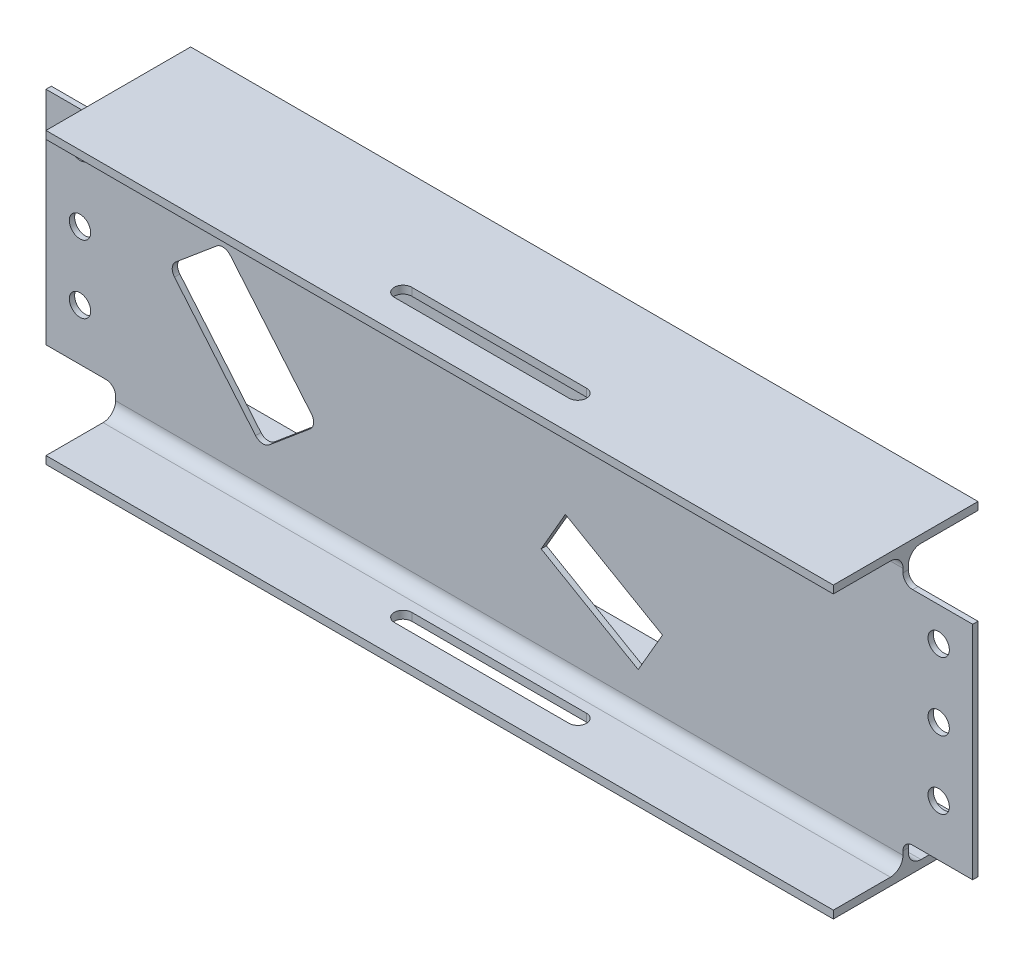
ISO-10303-21;
HEADER;
FILE_DESCRIPTION(('STEP AP214'),'2;1');
FILE_NAME('part.step','',(''),(''),'','','');
FILE_SCHEMA(('AUTOMOTIVE_DESIGN { 1 0 10303 214 1 1 1 1 }'));
ENDSEC;
DATA;
#1=APPLICATION_CONTEXT('core data for automotive mechanical design processes');
#2=APPLICATION_PROTOCOL_DEFINITION('international standard','automotive_design',2000,#1);
#3=PRODUCT_CONTEXT('',#1,'mechanical');
#4=PRODUCT('Part','Part','',(#3));
#5=PRODUCT_RELATED_PRODUCT_CATEGORY('part','',(#4));
#6=PRODUCT_DEFINITION_FORMATION('','',#4);
#7=PRODUCT_DEFINITION_CONTEXT('part definition',#1,'design');
#8=PRODUCT_DEFINITION('design','',#6,#7);
#9=PRODUCT_DEFINITION_SHAPE('','',#8);
#10=(LENGTH_UNIT() NAMED_UNIT(*) SI_UNIT(.MILLI.,.METRE.));
#11=(NAMED_UNIT(*) PLANE_ANGLE_UNIT() SI_UNIT($,.RADIAN.));
#12=(NAMED_UNIT(*) SI_UNIT($,.STERADIAN.) SOLID_ANGLE_UNIT());
#13=UNCERTAINTY_MEASURE_WITH_UNIT(LENGTH_MEASURE(1.E-05),#10,'distance_accuracy_value','');
#14=(GEOMETRIC_REPRESENTATION_CONTEXT(3) GLOBAL_UNCERTAINTY_ASSIGNED_CONTEXT((#13)) GLOBAL_UNIT_ASSIGNED_CONTEXT((#10,
#11,#12)) REPRESENTATION_CONTEXT('',''));
#15=CARTESIAN_POINT('',(0.,0.,0.));
#16=DIRECTION('',(0.,0.,1.));
#17=DIRECTION('',(1.,0.,0.));
#18=AXIS2_PLACEMENT_3D('',#15,#16,#17);
#19=CARTESIAN_POINT('',(1000.,-7.9999999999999,-74.4999999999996));
#20=DIRECTION('',(0.,-1.,0.));
#21=DIRECTION('',(0.,0.,-1.));
#22=AXIS2_PLACEMENT_3D('',#19,#20,#21);
#23=PLANE('',#22);
#24=DIRECTION('',(-1.,0.,0.));
#25=VECTOR('',#24,1.);
#26=CARTESIAN_POINT('',(1000.,-8.00000000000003,-15.7499999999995));
#27=LINE('',#26,#25);
#28=CARTESIAN_POINT('',(905.5,-7.99999999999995,-15.7500000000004));
#29=VERTEX_POINT('',#28);
#30=CARTESIAN_POINT('',(94.4999999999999,-8.00000000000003,-15.7499999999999));
#31=VERTEX_POINT('',#30);
#32=EDGE_CURVE('E760',#29,#31,#27,.T.);
#33=ORIENTED_EDGE('',*,*,#32,.T.);
#34=DIRECTION('',(0.,0.,-1.));
#35=VECTOR('',#34,1.);
#36=CARTESIAN_POINT('',(94.5,-7.9999999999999,-74.5000000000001));
#37=LINE('',#36,#35);
#38=CARTESIAN_POINT('',(94.5,-7.9999999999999,-74.5000000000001));
#39=VERTEX_POINT('',#38);
#40=EDGE_CURVE('E587',#31,#39,#37,.T.);
#41=ORIENTED_EDGE('',*,*,#40,.T.);
#42=DIRECTION('',(-1.,0.,0.));
#43=VECTOR('',#42,1.);
#44=CARTESIAN_POINT('',(1000.,-7.9999999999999,-74.4999999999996));
#45=LINE('',#44,#43);
#46=CARTESIAN_POINT('',(905.5,-7.9999999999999,-74.5000000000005));
#47=VERTEX_POINT('',#46);
#48=EDGE_CURVE('E12',#47,#39,#45,.T.);
#49=ORIENTED_EDGE('',*,*,#48,.F.);
#50=DIRECTION('',(0.,0.,-1.));
#51=VECTOR('',#50,1.);
#52=CARTESIAN_POINT('',(905.5,-7.9999999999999,-74.5000000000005));
#53=LINE('',#52,#51);
#54=EDGE_CURVE('E698',#29,#47,#53,.T.);
#55=ORIENTED_EDGE('',*,*,#54,.F.);
#56=EDGE_LOOP('',(#33,#41,#49,#55));
#57=FACE_BOUND('',#56,.T.);
#58=ADVANCED_FACE('F91',(#57),#23,.T.);
#59=CARTESIAN_POINT('',(1000.,0.,-74.4999999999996));
#60=DIRECTION('',(0.,0.,-1.));
#61=DIRECTION('',(0.,1.,0.));
#62=AXIS2_PLACEMENT_3D('',#59,#60,#61);
#63=PLANE('',#62);
#64=ORIENTED_EDGE('',*,*,#48,.T.);
#65=DIRECTION('',(0.,1.,0.));
#66=VECTOR('',#65,1.);
#67=CARTESIAN_POINT('',(94.5,0.,-74.5));
#68=LINE('',#67,#66);
#69=CARTESIAN_POINT('',(94.5,0.,-74.5));
#70=VERTEX_POINT('',#69);
#71=EDGE_CURVE('E590',#39,#70,#68,.T.);
#72=ORIENTED_EDGE('',*,*,#71,.T.);
#73=DIRECTION('',(-1.,0.,0.));
#74=VECTOR('',#73,1.);
#75=CARTESIAN_POINT('',(1000.,0.,-74.4999999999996));
#76=LINE('',#75,#74);
#77=CARTESIAN_POINT('',(905.5,0.,-74.5000000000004));
#78=VERTEX_POINT('',#77);
#79=EDGE_CURVE('E99',#78,#70,#76,.T.);
#80=ORIENTED_EDGE('',*,*,#79,.F.);
#81=DIRECTION('',(0.,1.,0.));
#82=VECTOR('',#81,1.);
#83=CARTESIAN_POINT('',(905.5,0.,-74.5000000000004));
#84=LINE('',#83,#82);
#85=EDGE_CURVE('E696',#47,#78,#84,.T.);
#86=ORIENTED_EDGE('',*,*,#85,.F.);
#87=EDGE_LOOP('',(#64,#72,#80,#86));
#88=FACE_BOUND('',#87,.T.);
#89=ADVANCED_FACE('F917',(#88),#63,.T.);
#90=CARTESIAN_POINT('',(1000.,0.,74.5000000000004));
#91=DIRECTION('',(0.,1.,0.));
#92=DIRECTION('',(0.,0.,1.));
#93=AXIS2_PLACEMENT_3D('',#90,#91,#92);
#94=PLANE('',#93);
#95=CARTESIAN_POINT('',(422.75,0.,35.));
#96=DIRECTION('',(0.,1.,0.));
#97=DIRECTION('',(0.,0.,1.));
#98=AXIS2_PLACEMENT_3D('',#95,#96,#97);
#99=CIRCLE('',#98,9.00000000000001);
#100=CARTESIAN_POINT('',(422.75,0.,26.));
#101=VERTEX_POINT('',#100);
#102=CARTESIAN_POINT('',(422.75,0.,44.));
#103=VERTEX_POINT('',#102);
#104=EDGE_CURVE('E107',#101,#103,#99,.T.);
#105=ORIENTED_EDGE('',*,*,#104,.F.);
#106=DIRECTION('',(-1.,0.,0.));
#107=VECTOR('',#106,1.);
#108=CARTESIAN_POINT('',(422.75,0.,26.));
#109=LINE('',#108,#107);
#110=CARTESIAN_POINT('',(602.75,0.,26.));
#111=VERTEX_POINT('',#110);
#112=EDGE_CURVE('E425',#111,#101,#109,.T.);
#113=ORIENTED_EDGE('',*,*,#112,.F.);
#114=CARTESIAN_POINT('',(602.75,0.,35.));
#115=DIRECTION('',(0.,1.,0.));
#116=DIRECTION('',(0.,0.,1.));
#117=AXIS2_PLACEMENT_3D('',#114,#115,#116);
#118=CIRCLE('',#117,9.00000000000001);
#119=CARTESIAN_POINT('',(602.75,0.,44.));
#120=VERTEX_POINT('',#119);
#121=EDGE_CURVE('E428',#120,#111,#118,.T.);
#122=ORIENTED_EDGE('',*,*,#121,.F.);
#123=DIRECTION('',(1.,0.,0.));
#124=VECTOR('',#123,1.);
#125=CARTESIAN_POINT('',(422.75,0.,44.));
#126=LINE('',#125,#124);
#127=EDGE_CURVE('E434',#103,#120,#126,.T.);
#128=ORIENTED_EDGE('',*,*,#127,.F.);
#129=EDGE_LOOP('',(#105,#113,#122,#128));
#130=FACE_BOUND('',#129,.T.);
#131=ORIENTED_EDGE('',*,*,#79,.T.);
#132=DIRECTION('',(0.,0.,1.));
#133=VECTOR('',#132,1.);
#134=CARTESIAN_POINT('',(94.5,0.,74.5));
#135=LINE('',#134,#133);
#136=CARTESIAN_POINT('',(94.5,0.,74.5));
#137=VERTEX_POINT('',#136);
#138=EDGE_CURVE('E593',#70,#137,#135,.T.);
#139=ORIENTED_EDGE('',*,*,#138,.T.);
#140=DIRECTION('',(-1.,0.,0.));
#141=VECTOR('',#140,1.);
#142=CARTESIAN_POINT('',(1000.,0.,74.5000000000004));
#143=LINE('',#142,#141);
#144=CARTESIAN_POINT('',(905.5,0.,74.4999999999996));
#145=VERTEX_POINT('',#144);
#146=EDGE_CURVE('E799',#145,#137,#143,.T.);
#147=ORIENTED_EDGE('',*,*,#146,.F.);
#148=DIRECTION('',(0.,0.,-1.));
#149=VECTOR('',#148,1.);
#150=CARTESIAN_POINT('',(905.5,0.,-74.5000000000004));
#151=LINE('',#150,#149);
#152=EDGE_CURVE('E693',#145,#78,#151,.T.);
#153=ORIENTED_EDGE('',*,*,#152,.T.);
#154=EDGE_LOOP('',(#131,#139,#147,#153));
#155=FACE_BOUND('',#154,.T.);
#156=ADVANCED_FACE('F914',(#130,#155),#94,.T.);
#157=CARTESIAN_POINT('',(1000.,0.,74.5000000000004));
#158=DIRECTION('',(0.,0.,-1.));
#159=DIRECTION('',(0.,1.,0.));
#160=AXIS2_PLACEMENT_3D('',#157,#158,#159);
#161=PLANE('',#160);
#162=DIRECTION('',(0.,1.,0.));
#163=VECTOR('',#162,1.);
#164=CARTESIAN_POINT('',(94.5,0.,74.5));
#165=LINE('',#164,#163);
#166=CARTESIAN_POINT('',(94.5,-7.9999999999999,74.5000000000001));
#167=VERTEX_POINT('',#166);
#168=EDGE_CURVE('E596',#167,#137,#165,.T.);
#169=ORIENTED_EDGE('',*,*,#168,.F.);
#170=DIRECTION('',(-1.,0.,0.));
#171=VECTOR('',#170,1.);
#172=CARTESIAN_POINT('',(1000.,-7.9999999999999,74.5000000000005));
#173=LINE('',#172,#171);
#174=CARTESIAN_POINT('',(905.5,-7.9999999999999,74.4999999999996));
#175=VERTEX_POINT('',#174);
#176=EDGE_CURVE('E796',#175,#167,#173,.T.);
#177=ORIENTED_EDGE('',*,*,#176,.F.);
#178=DIRECTION('',(0.,1.,0.));
#179=VECTOR('',#178,1.);
#180=CARTESIAN_POINT('',(905.5,0.,74.4999999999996));
#181=LINE('',#180,#179);
#182=EDGE_CURVE('E690',#175,#145,#181,.T.);
#183=ORIENTED_EDGE('',*,*,#182,.T.);
#184=ORIENTED_EDGE('',*,*,#146,.T.);
#185=EDGE_LOOP('',(#169,#177,#183,#184));
#186=FACE_BOUND('',#185,.T.);
#187=ADVANCED_FACE('F911',(#186),#161,.F.);
#188=CARTESIAN_POINT('',(1000.,-7.9999999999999,74.5000000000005));
#189=DIRECTION('',(0.,1.,0.));
#190=DIRECTION('',(0.,0.,1.));
#191=AXIS2_PLACEMENT_3D('',#188,#189,#190);
#192=PLANE('',#191);
#193=DIRECTION('',(-1.,0.,0.));
#194=VECTOR('',#193,1.);
#195=CARTESIAN_POINT('',(1000.,-7.99999999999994,26.));
#196=LINE('',#195,#194);
#197=CARTESIAN_POINT('',(602.75,-7.99999999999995,26.));
#198=VERTEX_POINT('',#197);
#199=CARTESIAN_POINT('',(422.75,-7.99999999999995,26.));
#200=VERTEX_POINT('',#199);
#201=EDGE_CURVE('E458',#198,#200,#196,.T.);
#202=ORIENTED_EDGE('',*,*,#201,.T.);
#203=CARTESIAN_POINT('',(422.75,-7.99999999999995,35.));
#204=DIRECTION('',(0.,1.,0.));
#205=DIRECTION('',(0.,0.,1.));
#206=AXIS2_PLACEMENT_3D('',#203,#204,#205);
#207=CIRCLE('',#206,9.00000000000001);
#208=CARTESIAN_POINT('',(422.75,-7.99999999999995,44.));
#209=VERTEX_POINT('',#208);
#210=EDGE_CURVE('E462',#200,#209,#207,.T.);
#211=ORIENTED_EDGE('',*,*,#210,.T.);
#212=DIRECTION('',(1.,0.,0.));
#213=VECTOR('',#212,1.);
#214=CARTESIAN_POINT('',(1000.,-7.99999999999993,44.));
#215=LINE('',#214,#213);
#216=CARTESIAN_POINT('',(602.75,-7.99999999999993,44.));
#217=VERTEX_POINT('',#216);
#218=EDGE_CURVE('E448',#209,#217,#215,.T.);
#219=ORIENTED_EDGE('',*,*,#218,.T.);
#220=CARTESIAN_POINT('',(602.75,-7.99999999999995,35.));
#221=DIRECTION('',(0.,1.,0.));
#222=DIRECTION('',(0.,0.,1.));
#223=AXIS2_PLACEMENT_3D('',#220,#221,#222);
#224=CIRCLE('',#223,9.00000000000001);
#225=EDGE_CURVE('E453',#217,#198,#224,.T.);
#226=ORIENTED_EDGE('',*,*,#225,.T.);
#227=EDGE_LOOP('',(#202,#211,#219,#226));
#228=FACE_BOUND('',#227,.T.);
#229=DIRECTION('',(0.,0.,1.));
#230=VECTOR('',#229,1.);
#231=CARTESIAN_POINT('',(94.5,-7.9999999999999,74.5000000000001));
#232=LINE('',#231,#230);
#233=CARTESIAN_POINT('',(94.5,-7.99999999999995,15.75));
#234=VERTEX_POINT('',#233);
#235=EDGE_CURVE('E598',#234,#167,#232,.T.);
#236=ORIENTED_EDGE('',*,*,#235,.F.);
#237=DIRECTION('',(-1.,0.,0.));
#238=VECTOR('',#237,1.);
#239=CARTESIAN_POINT('',(1000.,-7.99999999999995,15.7500000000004));
#240=LINE('',#239,#238);
#241=CARTESIAN_POINT('',(905.5,-8.00000000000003,15.7499999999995));
#242=VERTEX_POINT('',#241);
#243=EDGE_CURVE('E793',#242,#234,#240,.T.);
#244=ORIENTED_EDGE('',*,*,#243,.F.);
#245=DIRECTION('',(0.,0.,1.));
#246=VECTOR('',#245,1.);
#247=CARTESIAN_POINT('',(905.5,-7.9999999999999,74.4999999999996));
#248=LINE('',#247,#246);
#249=EDGE_CURVE('E687',#242,#175,#248,.T.);
#250=ORIENTED_EDGE('',*,*,#249,.T.);
#251=ORIENTED_EDGE('',*,*,#176,.T.);
#252=EDGE_LOOP('',(#236,#244,#250,#251));
#253=FACE_BOUND('',#252,.T.);
#254=ADVANCED_FACE('F905',(#228,#253),#192,.F.);
#255=CARTESIAN_POINT('',(1000.,-20.9999999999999,15.7500000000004));
#256=DIRECTION('',(-1.,0.,0.));
#257=DIRECTION('',(0.,0.,1.));
#258=AXIS2_PLACEMENT_3D('',#255,#256,#257);
#259=CYLINDRICAL_SURFACE('',#258,12.9999999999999);
#260=CARTESIAN_POINT('',(94.5,-20.9999999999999,15.75));
#261=DIRECTION('',(-1.,0.,0.));
#262=DIRECTION('',(0.,-1.,0.));
#263=AXIS2_PLACEMENT_3D('',#260,#261,#262);
#264=CIRCLE('',#263,12.9999999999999);
#265=CARTESIAN_POINT('',(94.5,-21.,2.75000000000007));
#266=VERTEX_POINT('',#265);
#267=EDGE_CURVE('E600',#266,#234,#264,.F.);
#268=ORIENTED_EDGE('',*,*,#267,.F.);
#269=DIRECTION('',(-1.,0.,0.));
#270=VECTOR('',#269,1.);
#271=CARTESIAN_POINT('',(1000.,-21.,2.75000000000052));
#272=LINE('',#271,#270);
#273=CARTESIAN_POINT('',(905.5,-21.,2.74999999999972));
#274=VERTEX_POINT('',#273);
#275=EDGE_CURVE('E790',#274,#266,#272,.T.);
#276=ORIENTED_EDGE('',*,*,#275,.F.);
#277=CARTESIAN_POINT('',(905.5,-20.9999999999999,15.7499999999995));
#278=DIRECTION('',(1.,0.,0.));
#279=DIRECTION('',(0.,-1.,0.));
#280=AXIS2_PLACEMENT_3D('',#277,#278,#279);
#281=CIRCLE('',#280,12.9999999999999);
#282=EDGE_CURVE('E739',#274,#242,#281,.T.);
#283=ORIENTED_EDGE('',*,*,#282,.T.);
#284=ORIENTED_EDGE('',*,*,#243,.T.);
#285=EDGE_LOOP('',(#268,#276,#283,#284));
#286=FACE_BOUND('',#285,.T.);
#287=ADVANCED_FACE('F829',(#286),#259,.F.);
#288=CARTESIAN_POINT('',(1000.,-21.,2.75000000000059));
#289=DIRECTION('',(0.,0.,-1.));
#290=DIRECTION('',(-1.,0.,0.));
#291=AXIS2_PLACEMENT_3D('',#288,#289,#290);
#292=PLANE('',#291);
#293=DIRECTION('',(-0.766044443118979,-0.642787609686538,0.));
#294=VECTOR('',#293,1.);
#295=CARTESIAN_POINT('',(797.730756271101,220.055097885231,2.75000000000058));
#296=LINE('',#295,#294);
#297=CARTESIAN_POINT('',(294.872709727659,-201.892903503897,2.75000000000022));
#298=VERTEX_POINT('',#297);
#299=CARTESIAN_POINT('',(252.740265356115,-237.246222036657,2.75000000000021));
#300=VERTEX_POINT('',#299);
#301=EDGE_CURVE('E523',#298,#300,#296,.T.);
#302=ORIENTED_EDGE('',*,*,#301,.T.);
#303=CARTESIAN_POINT('',(246.31238925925,-229.585777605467,2.7500000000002));
#304=DIRECTION('',(0.,0.,-1.));
#305=DIRECTION('',(-1.,0.,0.));
#306=AXIS2_PLACEMENT_3D('',#303,#304,#305);
#307=CIRCLE('',#306,9.99999999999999);
#308=CARTESIAN_POINT('',(238.65194482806,-236.013653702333,2.75000000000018));
#309=VERTEX_POINT('',#308);
#310=EDGE_CURVE('E526',#300,#309,#307,.T.);
#311=ORIENTED_EDGE('',*,*,#310,.T.);
#312=DIRECTION('',(-0.642787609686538,0.766044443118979,0.));
#313=VECTOR('',#312,1.);
#314=CARTESIAN_POINT('',(447.349064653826,-484.729196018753,2.75000000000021));
#315=LINE('',#314,#313);
#316=CARTESIAN_POINT('',(155.08955556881,-136.427876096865,2.75000000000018));
#317=VERTEX_POINT('',#316);
#318=EDGE_CURVE('E491',#309,#317,#315,.T.);
#319=ORIENTED_EDGE('',*,*,#318,.T.);
#320=CARTESIAN_POINT('',(162.75,-130.,2.7500000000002));
#321=DIRECTION('',(0.,0.,-1.));
#322=DIRECTION('',(-1.,0.,0.));
#323=AXIS2_PLACEMENT_3D('',#320,#321,#322);
#324=CIRCLE('',#323,10.);
#325=CARTESIAN_POINT('',(156.322123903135,-122.33955556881,2.7500000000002));
#326=VERTEX_POINT('',#325);
#327=EDGE_CURVE('E508',#317,#326,#324,.T.);
#328=ORIENTED_EDGE('',*,*,#327,.T.);
#329=DIRECTION('',(0.76604444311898,0.642787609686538,0.));
#330=VECTOR('',#329,1.);
#331=CARTESIAN_POINT('',(701.312614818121,334.961764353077,2.75000000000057));
#332=LINE('',#331,#330);
#333=CARTESIAN_POINT('',(198.454568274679,-86.9862370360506,2.75000000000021));
#334=VERTEX_POINT('',#333);
#335=EDGE_CURVE('E511',#326,#334,#332,.T.);
#336=ORIENTED_EDGE('',*,*,#335,.T.);
#337=CARTESIAN_POINT('',(204.882444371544,-94.6466814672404,2.75000000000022));
#338=DIRECTION('',(0.,0.,-1.));
#339=DIRECTION('',(-1.,0.,0.));
#340=AXIS2_PLACEMENT_3D('',#337,#338,#339);
#341=CIRCLE('',#340,10.);
#342=CARTESIAN_POINT('',(212.542888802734,-88.2188053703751,2.75000000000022));
#343=VERTEX_POINT('',#342);
#344=EDGE_CURVE('E514',#334,#343,#341,.T.);
#345=ORIENTED_EDGE('',*,*,#344,.T.);
#346=DIRECTION('',(0.642787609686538,-0.76604444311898,0.));
#347=VECTOR('',#346,1.);
#348=CARTESIAN_POINT('',(504.802397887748,-436.520125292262,2.75000000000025));
#349=LINE('',#348,#347);
#350=CARTESIAN_POINT('',(296.105278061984,-187.804582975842,2.75000000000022));
#351=VERTEX_POINT('',#350);
#352=EDGE_CURVE('E517',#343,#351,#349,.T.);
#353=ORIENTED_EDGE('',*,*,#352,.T.);
#354=CARTESIAN_POINT('',(288.444833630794,-194.232459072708,2.75000000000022));
#355=DIRECTION('',(0.,0.,-1.));
#356=DIRECTION('',(-1.,0.,0.));
#357=AXIS2_PLACEMENT_3D('',#354,#355,#356);
#358=CIRCLE('',#357,9.99999999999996);
#359=EDGE_CURVE('E520',#351,#298,#358,.T.);
#360=ORIENTED_EDGE('',*,*,#359,.T.);
#361=EDGE_LOOP('',(#302,#311,#319,#328,#336,#345,#353,#360));
#362=FACE_BOUND('',#361,.T.);
#363=DIRECTION('',(0.866025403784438,-0.500000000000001,0.));
#364=VECTOR('',#363,1.);
#365=CARTESIAN_POINT('',(835.008353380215,-306.773914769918,2.75000000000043));
#366=LINE('',#365,#364);
#367=CARTESIAN_POINT('',(557.75,-146.698729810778,2.75000000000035));
#368=VERTEX_POINT('',#367);
#369=CARTESIAN_POINT('',(657.75,-204.433756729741,2.75000000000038));
#370=VERTEX_POINT('',#369);
#371=EDGE_CURVE('E555',#368,#370,#366,.T.);
#372=ORIENTED_EDGE('',*,*,#371,.T.);
#373=DIRECTION('',(-0.500000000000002,-0.866025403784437,0.));
#374=VECTOR('',#373,1.);
#375=CARTESIAN_POINT('',(822.741646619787,81.340158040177,2.75000000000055));
#376=LINE('',#375,#374);
#377=CARTESIAN_POINT('',(632.75,-247.735026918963,2.75000000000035));
#378=VERTEX_POINT('',#377);
#379=EDGE_CURVE('E558',#370,#378,#376,.T.);
#380=ORIENTED_EDGE('',*,*,#379,.T.);
#381=DIRECTION('',(-0.866025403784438,0.500000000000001,0.));
#382=VECTOR('',#381,1.);
#383=CARTESIAN_POINT('',(810.008353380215,-350.07518495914,2.75000000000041));
#384=LINE('',#383,#382);
#385=CARTESIAN_POINT('',(532.75,-190.,2.75000000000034));
#386=VERTEX_POINT('',#385);
#387=EDGE_CURVE('E543',#378,#386,#384,.T.);
#388=ORIENTED_EDGE('',*,*,#387,.T.);
#389=DIRECTION('',(0.5,0.866025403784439,0.));
#390=VECTOR('',#389,1.);
#391=CARTESIAN_POINT('',(722.741646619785,139.07518495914,2.75000000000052));
#392=LINE('',#391,#390);
#393=EDGE_CURVE('E552',#386,#368,#392,.T.);
#394=ORIENTED_EDGE('',*,*,#393,.T.);
#395=EDGE_LOOP('',(#372,#380,#388,#394));
#396=FACE_BOUND('',#395,.T.);
#397=CARTESIAN_POINT('',(57.7500000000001,-70.,2.75000000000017));
#398=DIRECTION('',(0.,0.,-1.));
#399=DIRECTION('',(-1.,0.,0.));
#400=AXIS2_PLACEMENT_3D('',#397,#398,#399);
#401=CIRCLE('',#400,11.);
#402=CARTESIAN_POINT('',(46.7500000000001,-70.,2.75000000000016));
#403=VERTEX_POINT('',#402);
#404=EDGE_CURVE('E565',#403,#403,#401,.F.);
#405=ORIENTED_EDGE('',*,*,#404,.F.);
#406=EDGE_LOOP('',(#405));
#407=FACE_BOUND('',#406,.T.);
#408=CARTESIAN_POINT('',(57.7500000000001,-210.,2.75000000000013));
#409=DIRECTION('',(0.,0.,-1.));
#410=DIRECTION('',(-1.,0.,0.));
#411=AXIS2_PLACEMENT_3D('',#408,#409,#410);
#412=CIRCLE('',#411,11.0000000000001);
#413=CARTESIAN_POINT('',(46.75,-210.,2.75000000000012));
#414=VERTEX_POINT('',#413);
#415=EDGE_CURVE('E562',#414,#414,#412,.F.);
#416=ORIENTED_EDGE('',*,*,#415,.F.);
#417=EDGE_LOOP('',(#416));
#418=FACE_BOUND('',#417,.T.);
#419=CARTESIAN_POINT('',(57.7500000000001,-140.,2.75000000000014));
#420=DIRECTION('',(0.,0.,-1.));
#421=DIRECTION('',(-1.,0.,0.));
#422=AXIS2_PLACEMENT_3D('',#419,#420,#421);
#423=CIRCLE('',#422,11.);
#424=CARTESIAN_POINT('',(46.7500000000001,-140.,2.75000000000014));
#425=VERTEX_POINT('',#424);
#426=EDGE_CURVE('E569',#425,#425,#423,.F.);
#427=ORIENTED_EDGE('',*,*,#426,.F.);
#428=EDGE_LOOP('',(#427));
#429=FACE_BOUND('',#428,.T.);
#430=CARTESIAN_POINT('',(942.25,-70.,2.75000000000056));
#431=DIRECTION('',(0.,0.,-1.));
#432=DIRECTION('',(-1.,0.,0.));
#433=AXIS2_PLACEMENT_3D('',#430,#431,#432);
#434=CIRCLE('',#433,11.);
#435=CARTESIAN_POINT('',(931.25,-70.,2.75000000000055));
#436=VERTEX_POINT('',#435);
#437=EDGE_CURVE('E669',#436,#436,#434,.F.);
#438=ORIENTED_EDGE('',*,*,#437,.F.);
#439=EDGE_LOOP('',(#438));
#440=FACE_BOUND('',#439,.T.);
#441=CARTESIAN_POINT('',(942.25,-140.,2.75000000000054));
#442=DIRECTION('',(0.,0.,-1.));
#443=DIRECTION('',(-1.,0.,0.));
#444=AXIS2_PLACEMENT_3D('',#441,#442,#443);
#445=CIRCLE('',#444,11.);
#446=CARTESIAN_POINT('',(931.25,-140.,2.75000000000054));
#447=VERTEX_POINT('',#446);
#448=EDGE_CURVE('E661',#447,#447,#445,.F.);
#449=ORIENTED_EDGE('',*,*,#448,.F.);
#450=EDGE_LOOP('',(#449));
#451=FACE_BOUND('',#450,.T.);
#452=CARTESIAN_POINT('',(942.25,-210.,2.75000000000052));
#453=DIRECTION('',(0.,0.,-1.));
#454=DIRECTION('',(-1.,0.,0.));
#455=AXIS2_PLACEMENT_3D('',#452,#453,#454);
#456=CIRCLE('',#455,11.);
#457=CARTESIAN_POINT('',(931.25,-210.,2.75000000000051));
#458=VERTEX_POINT('',#457);
#459=EDGE_CURVE('E665',#458,#458,#456,.F.);
#460=ORIENTED_EDGE('',*,*,#459,.F.);
#461=EDGE_LOOP('',(#460));
#462=FACE_BOUND('',#461,.T.);
#463=DIRECTION('',(0.,1.,0.));
#464=VECTOR('',#463,1.);
#465=CARTESIAN_POINT('',(94.5,-21.,2.75000000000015));
#466=LINE('',#465,#464);
#467=CARTESIAN_POINT('',(94.5,-277.,2.75000000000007));
#468=VERTEX_POINT('',#467);
#469=CARTESIAN_POINT('',(94.5,-273.,2.75000000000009));
#470=VERTEX_POINT('',#469);
#471=EDGE_CURVE('E621',#468,#470,#466,.T.);
#472=ORIENTED_EDGE('',*,*,#471,.F.);
#473=DIRECTION('',(-1.,0.,0.));
#474=VECTOR('',#473,1.);
#475=CARTESIAN_POINT('',(1000.,-277.,2.75000000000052));
#476=LINE('',#475,#474);
#477=CARTESIAN_POINT('',(905.5,-277.,2.74999999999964));
#478=VERTEX_POINT('',#477);
#479=EDGE_CURVE('E787',#478,#468,#476,.T.);
#480=ORIENTED_EDGE('',*,*,#479,.F.);
#481=DIRECTION('',(0.,1.,0.));
#482=VECTOR('',#481,1.);
#483=CARTESIAN_POINT('',(905.5,-21.,2.74999999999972));
#484=LINE('',#483,#482);
#485=CARTESIAN_POINT('',(905.5,-273.,2.74999999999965));
#486=VERTEX_POINT('',#485);
#487=EDGE_CURVE('E742',#478,#486,#484,.T.);
#488=ORIENTED_EDGE('',*,*,#487,.T.);
#489=CARTESIAN_POINT('',(915.5,-273.,2.74999999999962));
#490=DIRECTION('',(0.,0.,1.));
#491=DIRECTION('',(0.,1.,0.));
#492=AXIS2_PLACEMENT_3D('',#489,#490,#491);
#493=CIRCLE('',#492,9.99999999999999);
#494=CARTESIAN_POINT('',(915.5,-263.,2.74999999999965));
#495=VERTEX_POINT('',#494);
#496=EDGE_CURVE('E745',#486,#495,#493,.F.);
#497=ORIENTED_EDGE('',*,*,#496,.T.);
#498=DIRECTION('',(1.,0.,0.));
#499=VECTOR('',#498,1.);
#500=CARTESIAN_POINT('',(800.,-263.,2.74999999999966));
#501=LINE('',#500,#499);
#502=CARTESIAN_POINT('',(977.25,-263.,2.74999999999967));
#503=VERTEX_POINT('',#502);
#504=EDGE_CURVE('E748',#495,#503,#501,.T.);
#505=ORIENTED_EDGE('',*,*,#504,.T.);
#506=DIRECTION('',(0.,1.,0.));
#507=VECTOR('',#506,1.);
#508=CARTESIAN_POINT('',(977.25,-21.,2.74999999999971));
#509=LINE('',#508,#507);
#510=CARTESIAN_POINT('',(977.25,-35.,2.7499999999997));
#511=VERTEX_POINT('',#510);
#512=EDGE_CURVE('E751',#503,#511,#509,.T.);
#513=ORIENTED_EDGE('',*,*,#512,.T.);
#514=DIRECTION('',(-1.,0.,0.));
#515=VECTOR('',#514,1.);
#516=CARTESIAN_POINT('',(800.,-35.,2.74999999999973));
#517=LINE('',#516,#515);
#518=CARTESIAN_POINT('',(915.5,-35.,2.74999999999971));
#519=VERTEX_POINT('',#518);
#520=EDGE_CURVE('E754',#511,#519,#517,.T.);
#521=ORIENTED_EDGE('',*,*,#520,.T.);
#522=CARTESIAN_POINT('',(915.5,-24.9999999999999,2.74999999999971));
#523=DIRECTION('',(0.,0.,1.));
#524=DIRECTION('',(0.,1.,0.));
#525=AXIS2_PLACEMENT_3D('',#522,#523,#524);
#526=CIRCLE('',#525,10.);
#527=CARTESIAN_POINT('',(905.5,-24.9999999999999,2.74999999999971));
#528=VERTEX_POINT('',#527);
#529=EDGE_CURVE('E757',#519,#528,#526,.F.);
#530=ORIENTED_EDGE('',*,*,#529,.T.);
#531=DIRECTION('',(0.,1.,0.));
#532=VECTOR('',#531,1.);
#533=CARTESIAN_POINT('',(905.5,-21.,2.74999999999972));
#534=LINE('',#533,#532);
#535=EDGE_CURVE('E684',#528,#274,#534,.T.);
#536=ORIENTED_EDGE('',*,*,#535,.T.);
#537=ORIENTED_EDGE('',*,*,#275,.T.);
#538=DIRECTION('',(0.,1.,0.));
#539=VECTOR('',#538,1.);
#540=CARTESIAN_POINT('',(94.5,-21.,2.75000000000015));
#541=LINE('',#540,#539);
#542=CARTESIAN_POINT('',(94.5,-24.9999999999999,2.75000000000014));
#543=VERTEX_POINT('',#542);
#544=EDGE_CURVE('E602',#543,#266,#541,.T.);
#545=ORIENTED_EDGE('',*,*,#544,.F.);
#546=CARTESIAN_POINT('',(84.5,-24.9999999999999,2.75000000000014));
#547=DIRECTION('',(0.,0.,-1.));
#548=DIRECTION('',(0.,1.,0.));
#549=AXIS2_PLACEMENT_3D('',#546,#547,#548);
#550=CIRCLE('',#549,9.99999999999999);
#551=CARTESIAN_POINT('',(84.5,-34.9999999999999,2.75000000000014));
#552=VERTEX_POINT('',#551);
#553=EDGE_CURVE('E624',#552,#543,#550,.F.);
#554=ORIENTED_EDGE('',*,*,#553,.F.);
#555=DIRECTION('',(1.,0.,0.));
#556=VECTOR('',#555,1.);
#557=CARTESIAN_POINT('',(200.,-34.9999999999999,2.75000000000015));
#558=LINE('',#557,#556);
#559=CARTESIAN_POINT('',(22.7500000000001,-35.,2.75000000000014));
#560=VERTEX_POINT('',#559);
#561=EDGE_CURVE('E627',#560,#552,#558,.T.);
#562=ORIENTED_EDGE('',*,*,#561,.F.);
#563=DIRECTION('',(0.,1.,0.));
#564=VECTOR('',#563,1.);
#565=CARTESIAN_POINT('',(22.7500000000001,-21.,2.75000000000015));
#566=LINE('',#565,#564);
#567=CARTESIAN_POINT('',(22.7500000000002,-263.,2.75000000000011));
#568=VERTEX_POINT('',#567);
#569=EDGE_CURVE('E630',#568,#560,#566,.T.);
#570=ORIENTED_EDGE('',*,*,#569,.F.);
#571=DIRECTION('',(-1.,0.,0.));
#572=VECTOR('',#571,1.);
#573=CARTESIAN_POINT('',(200.,-263.,2.75000000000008));
#574=LINE('',#573,#572);
#575=CARTESIAN_POINT('',(84.5,-263.,2.75000000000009));
#576=VERTEX_POINT('',#575);
#577=EDGE_CURVE('E633',#576,#568,#574,.T.);
#578=ORIENTED_EDGE('',*,*,#577,.F.);
#579=CARTESIAN_POINT('',(84.5,-273.,2.75000000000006));
#580=DIRECTION('',(0.,0.,-1.));
#581=DIRECTION('',(0.,1.,0.));
#582=AXIS2_PLACEMENT_3D('',#579,#580,#581);
#583=CIRCLE('',#582,10.);
#584=EDGE_CURVE('E636',#470,#576,#583,.F.);
#585=ORIENTED_EDGE('',*,*,#584,.F.);
#586=EDGE_LOOP('',(#472,#480,#488,#497,#505,#513,#521,#530,#536,#537,#545,#554,#562,#570,#578,#585));
#587=FACE_BOUND('',#586,.T.);
#588=ADVANCED_FACE('F825',(#362,#396,#407,#418,#429,#440,#451,#462,#587),#292,.F.);
#589=CARTESIAN_POINT('',(1000.,-277.,15.7500000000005));
#590=DIRECTION('',(-1.,0.,0.));
#591=DIRECTION('',(0.,0.,1.));
#592=AXIS2_PLACEMENT_3D('',#589,#590,#591);
#593=CYLINDRICAL_SURFACE('',#592,13.);
#594=ORIENTED_EDGE('',*,*,#479,.T.);
#595=CARTESIAN_POINT('',(94.5,-277.,15.7500000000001));
#596=DIRECTION('',(-1.,0.,0.));
#597=DIRECTION('',(0.,-1.,0.));
#598=AXIS2_PLACEMENT_3D('',#595,#596,#597);
#599=CIRCLE('',#598,13.);
#600=CARTESIAN_POINT('',(94.5,-290.,15.7500000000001));
#601=VERTEX_POINT('',#600);
#602=EDGE_CURVE('E618',#468,#601,#599,.T.);
#603=ORIENTED_EDGE('',*,*,#602,.T.);
#604=DIRECTION('',(-1.,0.,0.));
#605=VECTOR('',#604,1.);
#606=CARTESIAN_POINT('',(1000.,-290.,15.7500000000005));
#607=LINE('',#606,#605);
#608=CARTESIAN_POINT('',(905.5,-290.,15.7499999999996));
#609=VERTEX_POINT('',#608);
#610=EDGE_CURVE('E784',#609,#601,#607,.T.);
#611=ORIENTED_EDGE('',*,*,#610,.F.);
#612=CARTESIAN_POINT('',(905.5,-277.,15.7499999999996));
#613=DIRECTION('',(1.,0.,0.));
#614=DIRECTION('',(0.,-1.,0.));
#615=AXIS2_PLACEMENT_3D('',#612,#613,#614);
#616=CIRCLE('',#615,13.);
#617=EDGE_CURVE('E704',#478,#609,#616,.F.);
#618=ORIENTED_EDGE('',*,*,#617,.F.);
#619=EDGE_LOOP('',(#594,#603,#611,#618));
#620=FACE_BOUND('',#619,.T.);
#621=ADVANCED_FACE('F828',(#620),#593,.F.);
#622=CARTESIAN_POINT('',(1000.,-290.,74.5000000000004));
#623=DIRECTION('',(0.,1.,0.));
#624=DIRECTION('',(0.,0.,1.));
#625=AXIS2_PLACEMENT_3D('',#622,#623,#624);
#626=PLANE('',#625);
#627=CARTESIAN_POINT('',(422.75,-290.,35.));
#628=DIRECTION('',(0.,1.,0.));
#629=DIRECTION('',(0.,0.,1.));
#630=AXIS2_PLACEMENT_3D('',#627,#628,#629);
#631=CIRCLE('',#630,9.00000000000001);
#632=CARTESIAN_POINT('',(422.75,-290.,26.));
#633=VERTEX_POINT('',#632);
#634=CARTESIAN_POINT('',(422.75,-290.,44.));
#635=VERTEX_POINT('',#634);
#636=EDGE_CURVE('E406',#633,#635,#631,.T.);
#637=ORIENTED_EDGE('',*,*,#636,.F.);
#638=DIRECTION('',(-1.,0.,0.));
#639=VECTOR('',#638,1.);
#640=CARTESIAN_POINT('',(1000.,-290.,26.));
#641=LINE('',#640,#639);
#642=CARTESIAN_POINT('',(602.75,-290.,26.));
#643=VERTEX_POINT('',#642);
#644=EDGE_CURVE('E456',#643,#633,#641,.T.);
#645=ORIENTED_EDGE('',*,*,#644,.F.);
#646=CARTESIAN_POINT('',(602.75,-290.,35.));
#647=DIRECTION('',(0.,1.,0.));
#648=DIRECTION('',(0.,0.,1.));
#649=AXIS2_PLACEMENT_3D('',#646,#647,#648);
#650=CIRCLE('',#649,9.00000000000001);
#651=CARTESIAN_POINT('',(602.75,-290.,44.));
#652=VERTEX_POINT('',#651);
#653=EDGE_CURVE('E451',#652,#643,#650,.T.);
#654=ORIENTED_EDGE('',*,*,#653,.F.);
#655=DIRECTION('',(1.,0.,0.));
#656=VECTOR('',#655,1.);
#657=CARTESIAN_POINT('',(1000.,-290.,44.));
#658=LINE('',#657,#656);
#659=EDGE_CURVE('E440',#635,#652,#658,.T.);
#660=ORIENTED_EDGE('',*,*,#659,.F.);
#661=EDGE_LOOP('',(#637,#645,#654,#660));
#662=FACE_BOUND('',#661,.T.);
#663=ORIENTED_EDGE('',*,*,#610,.T.);
#664=DIRECTION('',(0.,0.,1.));
#665=VECTOR('',#664,1.);
#666=CARTESIAN_POINT('',(94.5,-290.,74.5));
#667=LINE('',#666,#665);
#668=CARTESIAN_POINT('',(94.5,-290.,74.5));
#669=VERTEX_POINT('',#668);
#670=EDGE_CURVE('E615',#601,#669,#667,.T.);
#671=ORIENTED_EDGE('',*,*,#670,.T.);
#672=DIRECTION('',(-1.,0.,0.));
#673=VECTOR('',#672,1.);
#674=CARTESIAN_POINT('',(1000.,-290.,74.5000000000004));
#675=LINE('',#674,#673);
#676=CARTESIAN_POINT('',(905.5,-290.,74.4999999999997));
#677=VERTEX_POINT('',#676);
#678=EDGE_CURVE('E781',#677,#669,#675,.T.);
#679=ORIENTED_EDGE('',*,*,#678,.F.);
#680=DIRECTION('',(0.,0.,1.));
#681=VECTOR('',#680,1.);
#682=CARTESIAN_POINT('',(905.5,-290.,74.4999999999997));
#683=LINE('',#682,#681);
#684=EDGE_CURVE('E706',#609,#677,#683,.T.);
#685=ORIENTED_EDGE('',*,*,#684,.F.);
#686=EDGE_LOOP('',(#663,#671,#679,#685));
#687=FACE_BOUND('',#686,.T.);
#688=ADVANCED_FACE('F854',(#662,#687),#626,.T.);
#689=CARTESIAN_POINT('',(1000.,-298.,74.5000000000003));
#690=DIRECTION('',(0.,0.,1.));
#691=DIRECTION('',(0.,-1.,0.));
#692=AXIS2_PLACEMENT_3D('',#689,#690,#691);
#693=PLANE('',#692);
#694=ORIENTED_EDGE('',*,*,#678,.T.);
#695=DIRECTION('',(0.,-1.,0.));
#696=VECTOR('',#695,1.);
#697=CARTESIAN_POINT('',(94.5,-298.,74.4999999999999));
#698=LINE('',#697,#696);
#699=CARTESIAN_POINT('',(94.5,-298.,74.4999999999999));
#700=VERTEX_POINT('',#699);
#701=EDGE_CURVE('E612',#669,#700,#698,.T.);
#702=ORIENTED_EDGE('',*,*,#701,.T.);
#703=DIRECTION('',(-1.,0.,0.));
#704=VECTOR('',#703,1.);
#705=CARTESIAN_POINT('',(1000.,-298.,74.5000000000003));
#706=LINE('',#705,#704);
#707=CARTESIAN_POINT('',(905.5,-298.,74.4999999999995));
#708=VERTEX_POINT('',#707);
#709=EDGE_CURVE('E778',#708,#700,#706,.T.);
#710=ORIENTED_EDGE('',*,*,#709,.F.);
#711=DIRECTION('',(0.,-1.,0.));
#712=VECTOR('',#711,1.);
#713=CARTESIAN_POINT('',(905.5,-298.,74.4999999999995));
#714=LINE('',#713,#712);
#715=EDGE_CURVE('E708',#677,#708,#714,.T.);
#716=ORIENTED_EDGE('',*,*,#715,.F.);
#717=EDGE_LOOP('',(#694,#702,#710,#716));
#718=FACE_BOUND('',#717,.T.);
#719=ADVANCED_FACE('F856',(#718),#693,.T.);
#720=CARTESIAN_POINT('',(1000.,-298.,74.5000000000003));
#721=DIRECTION('',(0.,1.,0.));
#722=DIRECTION('',(0.,0.,1.));
#723=AXIS2_PLACEMENT_3D('',#720,#721,#722);
#724=PLANE('',#723);
#725=DIRECTION('',(-1.,0.,0.));
#726=VECTOR('',#725,1.);
#727=CARTESIAN_POINT('',(422.75,-298.,26.));
#728=LINE('',#727,#726);
#729=CARTESIAN_POINT('',(602.75,-298.,26.));
#730=VERTEX_POINT('',#729);
#731=CARTESIAN_POINT('',(422.75,-298.,26.));
#732=VERTEX_POINT('',#731);
#733=EDGE_CURVE('E424',#730,#732,#728,.T.);
#734=ORIENTED_EDGE('',*,*,#733,.T.);
#735=CARTESIAN_POINT('',(422.75,-298.,35.));
#736=DIRECTION('',(0.,1.,0.));
#737=DIRECTION('',(0.,0.,1.));
#738=AXIS2_PLACEMENT_3D('',#735,#736,#737);
#739=CIRCLE('',#738,9.00000000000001);
#740=CARTESIAN_POINT('',(422.75,-298.,44.));
#741=VERTEX_POINT('',#740);
#742=EDGE_CURVE('E403',#732,#741,#739,.T.);
#743=ORIENTED_EDGE('',*,*,#742,.T.);
#744=DIRECTION('',(1.,0.,0.));
#745=VECTOR('',#744,1.);
#746=CARTESIAN_POINT('',(422.75,-298.,44.));
#747=LINE('',#746,#745);
#748=CARTESIAN_POINT('',(602.75,-298.,44.));
#749=VERTEX_POINT('',#748);
#750=EDGE_CURVE('E413',#741,#749,#747,.T.);
#751=ORIENTED_EDGE('',*,*,#750,.T.);
#752=CARTESIAN_POINT('',(602.75,-298.,35.));
#753=DIRECTION('',(0.,1.,0.));
#754=DIRECTION('',(0.,0.,1.));
#755=AXIS2_PLACEMENT_3D('',#752,#753,#754);
#756=CIRCLE('',#755,9.00000000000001);
#757=EDGE_CURVE('E419',#749,#730,#756,.T.);
#758=ORIENTED_EDGE('',*,*,#757,.T.);
#759=EDGE_LOOP('',(#734,#743,#751,#758));
#760=FACE_BOUND('',#759,.T.);
#761=DIRECTION('',(0.,0.,1.));
#762=VECTOR('',#761,1.);
#763=CARTESIAN_POINT('',(94.5,-298.,74.4999999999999));
#764=LINE('',#763,#762);
#765=CARTESIAN_POINT('',(94.5,-298.,-74.4999999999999));
#766=VERTEX_POINT('',#765);
#767=EDGE_CURVE('E610',#766,#700,#764,.T.);
#768=ORIENTED_EDGE('',*,*,#767,.F.);
#769=DIRECTION('',(-1.,0.,0.));
#770=VECTOR('',#769,1.);
#771=CARTESIAN_POINT('',(1000.,-298.,-74.4999999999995));
#772=LINE('',#771,#770);
#773=CARTESIAN_POINT('',(905.5,-298.,-74.5000000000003));
#774=VERTEX_POINT('',#773);
#775=EDGE_CURVE('E775',#774,#766,#772,.T.);
#776=ORIENTED_EDGE('',*,*,#775,.F.);
#777=DIRECTION('',(0.,0.,-1.));
#778=VECTOR('',#777,1.);
#779=CARTESIAN_POINT('',(905.5,-298.,-74.5000000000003));
#780=LINE('',#779,#778);
#781=EDGE_CURVE('E710',#708,#774,#780,.T.);
#782=ORIENTED_EDGE('',*,*,#781,.F.);
#783=ORIENTED_EDGE('',*,*,#709,.T.);
#784=EDGE_LOOP('',(#768,#776,#782,#783));
#785=FACE_BOUND('',#784,.T.);
#786=ADVANCED_FACE('F421',(#760,#785),#724,.F.);
#787=CARTESIAN_POINT('',(1000.,-298.,-74.4999999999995));
#788=DIRECTION('',(0.,0.,1.));
#789=DIRECTION('',(0.,-1.,0.));
#790=AXIS2_PLACEMENT_3D('',#787,#788,#789);
#791=PLANE('',#790);
#792=DIRECTION('',(0.,-1.,0.));
#793=VECTOR('',#792,1.);
#794=CARTESIAN_POINT('',(94.5,-298.,-74.4999999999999));
#795=LINE('',#794,#793);
#796=CARTESIAN_POINT('',(94.5,-290.,-74.5000000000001));
#797=VERTEX_POINT('',#796);
#798=EDGE_CURVE('E608',#797,#766,#795,.T.);
#799=ORIENTED_EDGE('',*,*,#798,.F.);
#800=DIRECTION('',(-1.,0.,0.));
#801=VECTOR('',#800,1.);
#802=CARTESIAN_POINT('',(1000.,-290.,-74.4999999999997));
#803=LINE('',#802,#801);
#804=CARTESIAN_POINT('',(905.5,-290.,-74.5000000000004));
#805=VERTEX_POINT('',#804);
#806=EDGE_CURVE('E772',#805,#797,#803,.T.);
#807=ORIENTED_EDGE('',*,*,#806,.F.);
#808=DIRECTION('',(0.,-1.,0.));
#809=VECTOR('',#808,1.);
#810=CARTESIAN_POINT('',(905.5,-298.,-74.5000000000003));
#811=LINE('',#810,#809);
#812=EDGE_CURVE('E712',#805,#774,#811,.T.);
#813=ORIENTED_EDGE('',*,*,#812,.T.);
#814=ORIENTED_EDGE('',*,*,#775,.T.);
#815=EDGE_LOOP('',(#799,#807,#813,#814));
#816=FACE_BOUND('',#815,.T.);
#817=ADVANCED_FACE('F863',(#816),#791,.F.);
#818=CARTESIAN_POINT('',(1000.,-290.,-74.4999999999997));
#819=DIRECTION('',(0.,-1.,0.));
#820=DIRECTION('',(0.,0.,-1.));
#821=AXIS2_PLACEMENT_3D('',#818,#819,#820);
#822=PLANE('',#821);
#823=DIRECTION('',(0.,0.,-1.));
#824=VECTOR('',#823,1.);
#825=CARTESIAN_POINT('',(94.5,-290.,-74.5000000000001));
#826=LINE('',#825,#824);
#827=CARTESIAN_POINT('',(94.5,-290.,-15.7500000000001));
#828=VERTEX_POINT('',#827);
#829=EDGE_CURVE('E606',#828,#797,#826,.T.);
#830=ORIENTED_EDGE('',*,*,#829,.F.);
#831=DIRECTION('',(-1.,0.,0.));
#832=VECTOR('',#831,1.);
#833=CARTESIAN_POINT('',(1000.,-290.,-15.7499999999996));
#834=LINE('',#833,#832);
#835=CARTESIAN_POINT('',(905.5,-290.,-15.7500000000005));
#836=VERTEX_POINT('',#835);
#837=EDGE_CURVE('E769',#836,#828,#834,.T.);
#838=ORIENTED_EDGE('',*,*,#837,.F.);
#839=DIRECTION('',(0.,0.,-1.));
#840=VECTOR('',#839,1.);
#841=CARTESIAN_POINT('',(905.5,-290.,-74.5000000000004));
#842=LINE('',#841,#840);
#843=EDGE_CURVE('E715',#836,#805,#842,.T.);
#844=ORIENTED_EDGE('',*,*,#843,.T.);
#845=ORIENTED_EDGE('',*,*,#806,.T.);
#846=EDGE_LOOP('',(#830,#838,#844,#845));
#847=FACE_BOUND('',#846,.T.);
#848=ADVANCED_FACE('F868',(#847),#822,.F.);
#849=CARTESIAN_POINT('',(1000.,-277.,-15.7499999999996));
#850=DIRECTION('',(-1.,0.,0.));
#851=DIRECTION('',(0.,0.,1.));
#852=AXIS2_PLACEMENT_3D('',#849,#850,#851);
#853=CYLINDRICAL_SURFACE('',#852,13.);
#854=CARTESIAN_POINT('',(94.5,-277.,-15.7500000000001));
#855=DIRECTION('',(-1.,0.,0.));
#856=DIRECTION('',(0.,-1.,0.));
#857=AXIS2_PLACEMENT_3D('',#854,#855,#856);
#858=CIRCLE('',#857,13.);
#859=CARTESIAN_POINT('',(94.5,-277.,-2.75000000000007));
#860=VERTEX_POINT('',#859);
#861=EDGE_CURVE('E604',#860,#828,#858,.F.);
#862=ORIENTED_EDGE('',*,*,#861,.F.);
#863=DIRECTION('',(-1.,0.,0.));
#864=VECTOR('',#863,1.);
#865=CARTESIAN_POINT('',(1000.,-277.,-2.74999999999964));
#866=LINE('',#865,#864);
#867=CARTESIAN_POINT('',(905.5,-277.,-2.75000000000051));
#868=VERTEX_POINT('',#867);
#869=EDGE_CURVE('E766',#868,#860,#866,.T.);
#870=ORIENTED_EDGE('',*,*,#869,.F.);
#871=CARTESIAN_POINT('',(905.5,-277.,-15.7500000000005));
#872=DIRECTION('',(1.,0.,0.));
#873=DIRECTION('',(0.,-1.,0.));
#874=AXIS2_PLACEMENT_3D('',#871,#872,#873);
#875=CIRCLE('',#874,13.);
#876=EDGE_CURVE('E718',#868,#836,#875,.T.);
#877=ORIENTED_EDGE('',*,*,#876,.T.);
#878=ORIENTED_EDGE('',*,*,#837,.T.);
#879=EDGE_LOOP('',(#862,#870,#877,#878));
#880=FACE_BOUND('',#879,.T.);
#881=ADVANCED_FACE('F871',(#880),#853,.F.);
#882=CARTESIAN_POINT('',(1000.,-21.,-2.74999999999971));
#883=DIRECTION('',(0.,0.,-1.));
#884=DIRECTION('',(-1.,0.,0.));
#885=AXIS2_PLACEMENT_3D('',#882,#883,#884);
#886=PLANE('',#885);
#887=CARTESIAN_POINT('',(246.31238925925,-229.585777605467,-2.74999999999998));
#888=DIRECTION('',(0.,0.,-1.));
#889=DIRECTION('',(1.,0.,0.));
#890=AXIS2_PLACEMENT_3D('',#887,#888,#889);
#891=CIRCLE('',#890,9.99999999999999);
#892=CARTESIAN_POINT('',(252.740265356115,-237.246222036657,-2.74999999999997));
#893=VERTEX_POINT('',#892);
#894=CARTESIAN_POINT('',(238.65194482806,-236.013653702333,-2.74999999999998));
#895=VERTEX_POINT('',#894);
#896=EDGE_CURVE('E465',#893,#895,#891,.T.);
#897=ORIENTED_EDGE('',*,*,#896,.F.);
#898=DIRECTION('',(-0.766044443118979,-0.642787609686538,0.));
#899=VECTOR('',#898,1.);
#900=CARTESIAN_POINT('',(294.872709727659,-201.892903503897,-2.74999999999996));
#901=LINE('',#900,#899);
#902=CARTESIAN_POINT('',(294.872709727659,-201.892903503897,-2.74999999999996));
#903=VERTEX_POINT('',#902);
#904=EDGE_CURVE('E485',#903,#893,#901,.T.);
#905=ORIENTED_EDGE('',*,*,#904,.F.);
#906=CARTESIAN_POINT('',(288.444833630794,-194.232459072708,-2.74999999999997));
#907=DIRECTION('',(0.,0.,-1.));
#908=DIRECTION('',(1.,0.,0.));
#909=AXIS2_PLACEMENT_3D('',#906,#907,#908);
#910=CIRCLE('',#909,9.99999999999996);
#911=CARTESIAN_POINT('',(296.105278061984,-187.804582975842,-2.74999999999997));
#912=VERTEX_POINT('',#911);
#913=EDGE_CURVE('E482',#912,#903,#910,.T.);
#914=ORIENTED_EDGE('',*,*,#913,.F.);
#915=DIRECTION('',(0.642787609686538,-0.766044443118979,0.));
#916=VECTOR('',#915,1.);
#917=CARTESIAN_POINT('',(296.105278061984,-187.804582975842,-2.74999999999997));
#918=LINE('',#917,#916);
#919=CARTESIAN_POINT('',(212.542888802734,-88.2188053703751,-2.75000000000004));
#920=VERTEX_POINT('',#919);
#921=EDGE_CURVE('E479',#920,#912,#918,.T.);
#922=ORIENTED_EDGE('',*,*,#921,.F.);
#923=CARTESIAN_POINT('',(204.882444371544,-94.6466814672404,-2.75000000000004));
#924=DIRECTION('',(0.,0.,-1.));
#925=DIRECTION('',(-1.,0.,0.));
#926=AXIS2_PLACEMENT_3D('',#923,#924,#925);
#927=CIRCLE('',#926,10.);
#928=CARTESIAN_POINT('',(198.454568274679,-86.9862370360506,-2.75000000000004));
#929=VERTEX_POINT('',#928);
#930=EDGE_CURVE('E476',#929,#920,#927,.T.);
#931=ORIENTED_EDGE('',*,*,#930,.F.);
#932=DIRECTION('',(0.766044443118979,0.642787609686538,0.));
#933=VECTOR('',#932,1.);
#934=CARTESIAN_POINT('',(198.454568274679,-86.9862370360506,-2.75000000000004));
#935=LINE('',#934,#933);
#936=CARTESIAN_POINT('',(156.322123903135,-122.33955556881,-2.75000000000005));
#937=VERTEX_POINT('',#936);
#938=EDGE_CURVE('E473',#937,#929,#935,.T.);
#939=ORIENTED_EDGE('',*,*,#938,.F.);
#940=CARTESIAN_POINT('',(162.75,-130.,-2.75000000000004));
#941=DIRECTION('',(0.,0.,-1.));
#942=DIRECTION('',(1.,0.,0.));
#943=AXIS2_PLACEMENT_3D('',#940,#941,#942);
#944=CIRCLE('',#943,10.);
#945=CARTESIAN_POINT('',(155.08955556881,-136.427876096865,-2.75000000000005));
#946=VERTEX_POINT('',#945);
#947=EDGE_CURVE('E470',#946,#937,#944,.T.);
#948=ORIENTED_EDGE('',*,*,#947,.F.);
#949=DIRECTION('',(-0.642787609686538,0.766044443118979,0.));
#950=VECTOR('',#949,1.);
#951=CARTESIAN_POINT('',(238.65194482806,-236.013653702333,-2.74999999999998));
#952=LINE('',#951,#950);
#953=EDGE_CURVE('E467',#895,#946,#952,.T.);
#954=ORIENTED_EDGE('',*,*,#953,.F.);
#955=EDGE_LOOP('',(#897,#905,#914,#922,#931,#939,#948,#954));
#956=FACE_BOUND('',#955,.T.);
#957=DIRECTION('',(-0.500000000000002,-0.866025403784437,0.));
#958=VECTOR('',#957,1.);
#959=CARTESIAN_POINT('',(657.75,-204.433756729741,-2.7499999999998));
#960=LINE('',#959,#958);
#961=CARTESIAN_POINT('',(657.75,-204.433756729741,-2.7499999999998));
#962=VERTEX_POINT('',#961);
#963=CARTESIAN_POINT('',(632.75,-247.735026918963,-2.7499999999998));
#964=VERTEX_POINT('',#963);
#965=EDGE_CURVE('E529',#962,#964,#960,.T.);
#966=ORIENTED_EDGE('',*,*,#965,.F.);
#967=DIRECTION('',(0.866025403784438,-0.500000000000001,0.));
#968=VECTOR('',#967,1.);
#969=CARTESIAN_POINT('',(657.75,-204.433756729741,-2.7499999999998));
#970=LINE('',#969,#968);
#971=CARTESIAN_POINT('',(557.75,-146.698729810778,-2.74999999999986));
#972=VERTEX_POINT('',#971);
#973=EDGE_CURVE('E537',#972,#962,#970,.T.);
#974=ORIENTED_EDGE('',*,*,#973,.F.);
#975=DIRECTION('',(0.5,0.866025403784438,0.));
#976=VECTOR('',#975,1.);
#977=CARTESIAN_POINT('',(557.75,-146.698729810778,-2.74999999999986));
#978=LINE('',#977,#976);
#979=CARTESIAN_POINT('',(532.75,-190.,-2.74999999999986));
#980=VERTEX_POINT('',#979);
#981=EDGE_CURVE('E534',#980,#972,#978,.T.);
#982=ORIENTED_EDGE('',*,*,#981,.F.);
#983=DIRECTION('',(-0.866025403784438,0.500000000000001,0.));
#984=VECTOR('',#983,1.);
#985=CARTESIAN_POINT('',(632.75,-247.735026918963,-2.7499999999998));
#986=LINE('',#985,#984);
#987=EDGE_CURVE('E531',#964,#980,#986,.T.);
#988=ORIENTED_EDGE('',*,*,#987,.F.);
#989=EDGE_LOOP('',(#966,#974,#982,#988));
#990=FACE_BOUND('',#989,.T.);
#991=CARTESIAN_POINT('',(57.7500000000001,-70.,-2.75000000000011));
#992=DIRECTION('',(0.,0.,-1.));
#993=DIRECTION('',(-1.,0.,0.));
#994=AXIS2_PLACEMENT_3D('',#991,#992,#993);
#995=CIRCLE('',#994,11.);
#996=CARTESIAN_POINT('',(46.7500000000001,-70.,-2.75000000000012));
#997=VERTEX_POINT('',#996);
#998=EDGE_CURVE('E94',#997,#997,#995,.F.);
#999=ORIENTED_EDGE('',*,*,#998,.T.);
#1000=EDGE_LOOP('',(#999));
#1001=FACE_BOUND('',#1000,.T.);
#1002=CARTESIAN_POINT('',(57.7500000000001,-210.,-2.75000000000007));
#1003=DIRECTION('',(0.,0.,-1.));
#1004=DIRECTION('',(-1.,0.,0.));
#1005=AXIS2_PLACEMENT_3D('',#1002,#1003,#1004);
#1006=CIRCLE('',#1005,11.0000000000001);
#1007=CARTESIAN_POINT('',(46.75,-210.,-2.75000000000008));
#1008=VERTEX_POINT('',#1007);
#1009=EDGE_CURVE('E561',#1008,#1008,#1006,.F.);
#1010=ORIENTED_EDGE('',*,*,#1009,.T.);
#1011=EDGE_LOOP('',(#1010));
#1012=FACE_BOUND('',#1011,.T.);
#1013=CARTESIAN_POINT('',(57.7500000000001,-140.,-2.7500000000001));
#1014=DIRECTION('',(0.,0.,-1.));
#1015=DIRECTION('',(-1.,0.,0.));
#1016=AXIS2_PLACEMENT_3D('',#1013,#1014,#1015);
#1017=CIRCLE('',#1016,11.);
#1018=CARTESIAN_POINT('',(46.7500000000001,-140.,-2.7500000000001));
#1019=VERTEX_POINT('',#1018);
#1020=EDGE_CURVE('E568',#1019,#1019,#1017,.F.);
#1021=ORIENTED_EDGE('',*,*,#1020,.T.);
#1022=EDGE_LOOP('',(#1021));
#1023=FACE_BOUND('',#1022,.T.);
#1024=CARTESIAN_POINT('',(942.25,-210.,-2.74999999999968));
#1025=DIRECTION('',(0.,0.,-1.));
#1026=DIRECTION('',(-1.,0.,0.));
#1027=AXIS2_PLACEMENT_3D('',#1024,#1025,#1026);
#1028=CIRCLE('',#1027,11.);
#1029=CARTESIAN_POINT('',(931.25,-210.,-2.74999999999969));
#1030=VERTEX_POINT('',#1029);
#1031=EDGE_CURVE('E664',#1030,#1030,#1028,.F.);
#1032=ORIENTED_EDGE('',*,*,#1031,.T.);
#1033=EDGE_LOOP('',(#1032));
#1034=FACE_BOUND('',#1033,.T.);
#1035=CARTESIAN_POINT('',(942.25,-140.,-2.7499999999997));
#1036=DIRECTION('',(0.,0.,-1.));
#1037=DIRECTION('',(-1.,0.,0.));
#1038=AXIS2_PLACEMENT_3D('',#1035,#1036,#1037);
#1039=CIRCLE('',#1038,11.);
#1040=CARTESIAN_POINT('',(931.25,-140.,-2.7499999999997));
#1041=VERTEX_POINT('',#1040);
#1042=EDGE_CURVE('E660',#1041,#1041,#1039,.F.);
#1043=ORIENTED_EDGE('',*,*,#1042,.T.);
#1044=EDGE_LOOP('',(#1043));
#1045=FACE_BOUND('',#1044,.T.);
#1046=CARTESIAN_POINT('',(942.25,-70.,-2.74999999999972));
#1047=DIRECTION('',(0.,0.,-1.));
#1048=DIRECTION('',(-1.,0.,0.));
#1049=AXIS2_PLACEMENT_3D('',#1046,#1047,#1048);
#1050=CIRCLE('',#1049,11.);
#1051=CARTESIAN_POINT('',(931.25,-70.,-2.74999999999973));
#1052=VERTEX_POINT('',#1051);
#1053=EDGE_CURVE('E668',#1052,#1052,#1050,.F.);
#1054=ORIENTED_EDGE('',*,*,#1053,.T.);
#1055=EDGE_LOOP('',(#1054));
#1056=FACE_BOUND('',#1055,.T.);
#1057=ORIENTED_EDGE('',*,*,#869,.T.);
#1058=DIRECTION('',(0.,1.,0.));
#1059=VECTOR('',#1058,1.);
#1060=CARTESIAN_POINT('',(94.5,-21.,-2.75000000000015));
#1061=LINE('',#1060,#1059);
#1062=CARTESIAN_POINT('',(94.5,-273.,-2.75000000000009));
#1063=VERTEX_POINT('',#1062);
#1064=EDGE_CURVE('E642',#860,#1063,#1061,.T.);
#1065=ORIENTED_EDGE('',*,*,#1064,.T.);
#1066=CARTESIAN_POINT('',(84.5,-273.,-2.75000000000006));
#1067=DIRECTION('',(0.,0.,-1.));
#1068=DIRECTION('',(0.,1.,0.));
#1069=AXIS2_PLACEMENT_3D('',#1066,#1067,#1068);
#1070=CIRCLE('',#1069,10.);
#1071=CARTESIAN_POINT('',(84.5,-263.,-2.75000000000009));
#1072=VERTEX_POINT('',#1071);
#1073=EDGE_CURVE('E645',#1063,#1072,#1070,.F.);
#1074=ORIENTED_EDGE('',*,*,#1073,.T.);
#1075=DIRECTION('',(-1.,0.,0.));
#1076=VECTOR('',#1075,1.);
#1077=CARTESIAN_POINT('',(200.,-263.,-2.75000000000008));
#1078=LINE('',#1077,#1076);
#1079=CARTESIAN_POINT('',(22.7500000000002,-263.,-2.75000000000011));
#1080=VERTEX_POINT('',#1079);
#1081=EDGE_CURVE('E648',#1072,#1080,#1078,.T.);
#1082=ORIENTED_EDGE('',*,*,#1081,.T.);
#1083=DIRECTION('',(0.,1.,0.));
#1084=VECTOR('',#1083,1.);
#1085=CARTESIAN_POINT('',(22.7500000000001,-21.,-2.75000000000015));
#1086=LINE('',#1085,#1084);
#1087=CARTESIAN_POINT('',(22.7500000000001,-35.,-2.75000000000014));
#1088=VERTEX_POINT('',#1087);
#1089=EDGE_CURVE('E651',#1080,#1088,#1086,.T.);
#1090=ORIENTED_EDGE('',*,*,#1089,.T.);
#1091=DIRECTION('',(1.,0.,0.));
#1092=VECTOR('',#1091,1.);
#1093=CARTESIAN_POINT('',(200.,-34.9999999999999,-2.75000000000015));
#1094=LINE('',#1093,#1092);
#1095=CARTESIAN_POINT('',(84.5,-34.9999999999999,-2.75000000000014));
#1096=VERTEX_POINT('',#1095);
#1097=EDGE_CURVE('E654',#1088,#1096,#1094,.T.);
#1098=ORIENTED_EDGE('',*,*,#1097,.T.);
#1099=CARTESIAN_POINT('',(84.5,-24.9999999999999,-2.75000000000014));
#1100=DIRECTION('',(0.,0.,-1.));
#1101=DIRECTION('',(0.,1.,0.));
#1102=AXIS2_PLACEMENT_3D('',#1099,#1100,#1101);
#1103=CIRCLE('',#1102,9.99999999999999);
#1104=CARTESIAN_POINT('',(94.5,-24.9999999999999,-2.75000000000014));
#1105=VERTEX_POINT('',#1104);
#1106=EDGE_CURVE('E657',#1096,#1105,#1103,.F.);
#1107=ORIENTED_EDGE('',*,*,#1106,.T.);
#1108=DIRECTION('',(0.,1.,0.));
#1109=VECTOR('',#1108,1.);
#1110=CARTESIAN_POINT('',(94.5,-21.,-2.75000000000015));
#1111=LINE('',#1110,#1109);
#1112=CARTESIAN_POINT('',(94.5,-21.,-2.75000000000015));
#1113=VERTEX_POINT('',#1112);
#1114=EDGE_CURVE('E584',#1105,#1113,#1111,.T.);
#1115=ORIENTED_EDGE('',*,*,#1114,.T.);
#1116=DIRECTION('',(-1.,0.,0.));
#1117=VECTOR('',#1116,1.);
#1118=CARTESIAN_POINT('',(1000.,-21.,-2.74999999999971));
#1119=LINE('',#1118,#1117);
#1120=CARTESIAN_POINT('',(905.5,-21.,-2.74999999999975));
#1121=VERTEX_POINT('',#1120);
#1122=EDGE_CURVE('E763',#1121,#1113,#1119,.T.);
#1123=ORIENTED_EDGE('',*,*,#1122,.F.);
#1124=DIRECTION('',(0.,1.,0.));
#1125=VECTOR('',#1124,1.);
#1126=CARTESIAN_POINT('',(905.5,-21.,-2.75000000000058));
#1127=LINE('',#1126,#1125);
#1128=CARTESIAN_POINT('',(905.5,-24.9999999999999,-2.75000000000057));
#1129=VERTEX_POINT('',#1128);
#1130=EDGE_CURVE('E702',#1129,#1121,#1127,.T.);
#1131=ORIENTED_EDGE('',*,*,#1130,.F.);
#1132=CARTESIAN_POINT('',(915.5,-24.9999999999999,-2.75000000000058));
#1133=DIRECTION('',(0.,0.,1.));
#1134=DIRECTION('',(0.,1.,0.));
#1135=AXIS2_PLACEMENT_3D('',#1132,#1133,#1134);
#1136=CIRCLE('',#1135,10.);
#1137=CARTESIAN_POINT('',(915.5,-35.,-2.75000000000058));
#1138=VERTEX_POINT('',#1137);
#1139=EDGE_CURVE('E724',#1138,#1129,#1136,.F.);
#1140=ORIENTED_EDGE('',*,*,#1139,.F.);
#1141=DIRECTION('',(-1.,0.,0.));
#1142=VECTOR('',#1141,1.);
#1143=CARTESIAN_POINT('',(800.,-35.,-2.75000000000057));
#1144=LINE('',#1143,#1142);
#1145=CARTESIAN_POINT('',(977.25,-35.,-2.75000000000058));
#1146=VERTEX_POINT('',#1145);
#1147=EDGE_CURVE('E727',#1146,#1138,#1144,.T.);
#1148=ORIENTED_EDGE('',*,*,#1147,.F.);
#1149=DIRECTION('',(0.,1.,0.));
#1150=VECTOR('',#1149,1.);
#1151=CARTESIAN_POINT('',(977.25,-21.,-2.75000000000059));
#1152=LINE('',#1151,#1150);
#1153=CARTESIAN_POINT('',(977.25,-263.,-2.75000000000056));
#1154=VERTEX_POINT('',#1153);
#1155=EDGE_CURVE('E730',#1154,#1146,#1152,.T.);
#1156=ORIENTED_EDGE('',*,*,#1155,.F.);
#1157=DIRECTION('',(1.,0.,0.));
#1158=VECTOR('',#1157,1.);
#1159=CARTESIAN_POINT('',(800.,-263.,-2.7500000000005));
#1160=LINE('',#1159,#1158);
#1161=CARTESIAN_POINT('',(915.5,-263.,-2.75000000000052));
#1162=VERTEX_POINT('',#1161);
#1163=EDGE_CURVE('E733',#1162,#1154,#1160,.T.);
#1164=ORIENTED_EDGE('',*,*,#1163,.F.);
#1165=CARTESIAN_POINT('',(915.5,-273.,-2.75000000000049));
#1166=DIRECTION('',(0.,0.,1.));
#1167=DIRECTION('',(0.,1.,0.));
#1168=AXIS2_PLACEMENT_3D('',#1165,#1166,#1167);
#1169=CIRCLE('',#1168,9.99999999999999);
#1170=CARTESIAN_POINT('',(905.5,-273.,-2.75000000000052));
#1171=VERTEX_POINT('',#1170);
#1172=EDGE_CURVE('E736',#1171,#1162,#1169,.F.);
#1173=ORIENTED_EDGE('',*,*,#1172,.F.);
#1174=DIRECTION('',(0.,1.,0.));
#1175=VECTOR('',#1174,1.);
#1176=CARTESIAN_POINT('',(905.5,-21.,-2.75000000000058));
#1177=LINE('',#1176,#1175);
#1178=EDGE_CURVE('E721',#868,#1171,#1177,.T.);
#1179=ORIENTED_EDGE('',*,*,#1178,.F.);
#1180=EDGE_LOOP('',(#1057,#1065,#1074,#1082,#1090,#1098,#1107,#1115,#1123,#1131,#1140,#1148,
#1156,#1164,#1173,#1179));
#1181=FACE_BOUND('',#1180,.T.);
#1182=ADVANCED_FACE('F814',(#956,#990,#1001,#1012,#1023,#1034,#1045,#1056,#1181),#886,.T.);
#1183=CARTESIAN_POINT('',(1000.,-20.9999999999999,-15.7499999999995));
#1184=DIRECTION('',(-1.,0.,0.));
#1185=DIRECTION('',(0.,0.,1.));
#1186=AXIS2_PLACEMENT_3D('',#1183,#1184,#1185);
#1187=CYLINDRICAL_SURFACE('',#1186,12.9999999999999);
#1188=ORIENTED_EDGE('',*,*,#1122,.T.);
#1189=CARTESIAN_POINT('',(94.5,-20.9999999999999,-15.75));
#1190=DIRECTION('',(-1.,0.,0.));
#1191=DIRECTION('',(0.,-1.,0.));
#1192=AXIS2_PLACEMENT_3D('',#1189,#1190,#1191);
#1193=CIRCLE('',#1192,12.9999999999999);
#1194=EDGE_CURVE('E639',#1113,#31,#1193,.T.);
#1195=ORIENTED_EDGE('',*,*,#1194,.T.);
#1196=ORIENTED_EDGE('',*,*,#32,.F.);
#1197=CARTESIAN_POINT('',(905.5,-20.9999999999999,-15.7500000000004));
#1198=DIRECTION('',(1.,0.,0.));
#1199=DIRECTION('',(0.,-1.,0.));
#1200=AXIS2_PLACEMENT_3D('',#1197,#1198,#1199);
#1201=CIRCLE('',#1200,12.9999999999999);
#1202=EDGE_CURVE('E700',#1121,#29,#1201,.F.);
#1203=ORIENTED_EDGE('',*,*,#1202,.F.);
#1204=EDGE_LOOP('',(#1188,#1195,#1196,#1203));
#1205=FACE_BOUND('',#1204,.T.);
#1206=ADVANCED_FACE('F925',(#1205),#1187,.F.);
#1207=CARTESIAN_POINT('',(915.5,-273.,-150.));
#1208=DIRECTION('',(0.,0.,1.));
#1209=DIRECTION('',(1.,0.,0.));
#1210=AXIS2_PLACEMENT_3D('',#1207,#1208,#1209);
#1211=CYLINDRICAL_SURFACE('',#1210,9.99999999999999);
#1212=DIRECTION('',(0.,0.,1.));
#1213=VECTOR('',#1212,1.);
#1214=CARTESIAN_POINT('',(905.5,-273.,-150.));
#1215=LINE('',#1214,#1213);
#1216=EDGE_CURVE('E672',#1171,#486,#1215,.T.);
#1217=ORIENTED_EDGE('',*,*,#1216,.F.);
#1218=ORIENTED_EDGE('',*,*,#1172,.T.);
#1219=DIRECTION('',(0.,0.,1.));
#1220=VECTOR('',#1219,1.);
#1221=CARTESIAN_POINT('',(915.5,-263.,-150.));
#1222=LINE('',#1221,#1220);
#1223=EDGE_CURVE('E682',#1162,#495,#1222,.T.);
#1224=ORIENTED_EDGE('',*,*,#1223,.T.);
#1225=ORIENTED_EDGE('',*,*,#496,.F.);
#1226=EDGE_LOOP('',(#1217,#1218,#1224,#1225));
#1227=FACE_BOUND('',#1226,.T.);
#1228=ADVANCED_FACE('F879',(#1227),#1211,.F.);
#1229=CARTESIAN_POINT('',(977.25,-263.,-150.));
#1230=DIRECTION('',(0.,-1.,0.));
#1231=DIRECTION('',(-1.,0.,0.));
#1232=AXIS2_PLACEMENT_3D('',#1229,#1230,#1231);
#1233=PLANE('',#1232);
#1234=ORIENTED_EDGE('',*,*,#1223,.F.);
#1235=ORIENTED_EDGE('',*,*,#1163,.T.);
#1236=DIRECTION('',(0.,0.,1.));
#1237=VECTOR('',#1236,1.);
#1238=CARTESIAN_POINT('',(977.25,-263.,-150.));
#1239=LINE('',#1238,#1237);
#1240=EDGE_CURVE('E680',#1154,#503,#1239,.T.);
#1241=ORIENTED_EDGE('',*,*,#1240,.T.);
#1242=ORIENTED_EDGE('',*,*,#504,.F.);
#1243=EDGE_LOOP('',(#1234,#1235,#1241,#1242));
#1244=FACE_BOUND('',#1243,.T.);
#1245=ADVANCED_FACE('F884',(#1244),#1233,.T.);
#1246=CARTESIAN_POINT('',(977.25,-35.,-150.));
#1247=DIRECTION('',(1.,0.,0.));
#1248=DIRECTION('',(0.,-1.,0.));
#1249=AXIS2_PLACEMENT_3D('',#1246,#1247,#1248);
#1250=PLANE('',#1249);
#1251=ORIENTED_EDGE('',*,*,#1240,.F.);
#1252=ORIENTED_EDGE('',*,*,#1155,.T.);
#1253=DIRECTION('',(0.,0.,1.));
#1254=VECTOR('',#1253,1.);
#1255=CARTESIAN_POINT('',(977.25,-35.,-150.));
#1256=LINE('',#1255,#1254);
#1257=EDGE_CURVE('E678',#1146,#511,#1256,.T.);
#1258=ORIENTED_EDGE('',*,*,#1257,.T.);
#1259=ORIENTED_EDGE('',*,*,#512,.F.);
#1260=EDGE_LOOP('',(#1251,#1252,#1258,#1259));
#1261=FACE_BOUND('',#1260,.T.);
#1262=ADVANCED_FACE('F886',(#1261),#1250,.T.);
#1263=CARTESIAN_POINT('',(915.5,-35.,-150.));
#1264=DIRECTION('',(0.,1.,0.));
#1265=DIRECTION('',(0.,0.,-1.));
#1266=AXIS2_PLACEMENT_3D('',#1263,#1264,#1265);
#1267=PLANE('',#1266);
#1268=ORIENTED_EDGE('',*,*,#1257,.F.);
#1269=ORIENTED_EDGE('',*,*,#1147,.T.);
#1270=DIRECTION('',(0.,0.,1.));
#1271=VECTOR('',#1270,1.);
#1272=CARTESIAN_POINT('',(915.5,-35.,-150.));
#1273=LINE('',#1272,#1271);
#1274=EDGE_CURVE('E676',#1138,#519,#1273,.T.);
#1275=ORIENTED_EDGE('',*,*,#1274,.T.);
#1276=ORIENTED_EDGE('',*,*,#520,.F.);
#1277=EDGE_LOOP('',(#1268,#1269,#1275,#1276));
#1278=FACE_BOUND('',#1277,.T.);
#1279=ADVANCED_FACE('F890',(#1278),#1267,.T.);
#1280=CARTESIAN_POINT('',(915.5,-24.9999999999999,-150.));
#1281=DIRECTION('',(0.,0.,1.));
#1282=DIRECTION('',(1.,0.,0.));
#1283=AXIS2_PLACEMENT_3D('',#1280,#1281,#1282);
#1284=CYLINDRICAL_SURFACE('',#1283,10.);
#1285=ORIENTED_EDGE('',*,*,#1274,.F.);
#1286=ORIENTED_EDGE('',*,*,#1139,.T.);
#1287=DIRECTION('',(0.,0.,1.));
#1288=VECTOR('',#1287,1.);
#1289=CARTESIAN_POINT('',(905.5,-24.9999999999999,-150.));
#1290=LINE('',#1289,#1288);
#1291=EDGE_CURVE('E674',#1129,#528,#1290,.T.);
#1292=ORIENTED_EDGE('',*,*,#1291,.T.);
#1293=ORIENTED_EDGE('',*,*,#529,.F.);
#1294=EDGE_LOOP('',(#1285,#1286,#1292,#1293));
#1295=FACE_BOUND('',#1294,.T.);
#1296=ADVANCED_FACE('F895',(#1295),#1284,.F.);
#1297=CARTESIAN_POINT('',(905.5,-273.,-150.));
#1298=DIRECTION('',(1.,0.,0.));
#1299=DIRECTION('',(0.,-1.,0.));
#1300=AXIS2_PLACEMENT_3D('',#1297,#1298,#1299);
#1301=PLANE('',#1300);
#1302=ORIENTED_EDGE('',*,*,#876,.F.);
#1303=ORIENTED_EDGE('',*,*,#1178,.T.);
#1304=ORIENTED_EDGE('',*,*,#1216,.T.);
#1305=ORIENTED_EDGE('',*,*,#487,.F.);
#1306=ORIENTED_EDGE('',*,*,#617,.T.);
#1307=ORIENTED_EDGE('',*,*,#684,.T.);
#1308=ORIENTED_EDGE('',*,*,#715,.T.);
#1309=ORIENTED_EDGE('',*,*,#781,.T.);
#1310=ORIENTED_EDGE('',*,*,#812,.F.);
#1311=ORIENTED_EDGE('',*,*,#843,.F.);
#1312=EDGE_LOOP('',(#1302,#1303,#1304,#1305,#1306,#1307,#1308,#1309,#1310,#1311));
#1313=FACE_BOUND('',#1312,.T.);
#1314=ADVANCED_FACE('F850',(#1313),#1301,.T.);
#1315=CARTESIAN_POINT('',(905.5,200.,-150.));
#1316=DIRECTION('',(1.,0.,0.));
#1317=DIRECTION('',(0.,-1.,0.));
#1318=AXIS2_PLACEMENT_3D('',#1315,#1316,#1317);
#1319=PLANE('',#1318);
#1320=ORIENTED_EDGE('',*,*,#1291,.F.);
#1321=ORIENTED_EDGE('',*,*,#1130,.T.);
#1322=ORIENTED_EDGE('',*,*,#1202,.T.);
#1323=ORIENTED_EDGE('',*,*,#54,.T.);
#1324=ORIENTED_EDGE('',*,*,#85,.T.);
#1325=ORIENTED_EDGE('',*,*,#152,.F.);
#1326=ORIENTED_EDGE('',*,*,#182,.F.);
#1327=ORIENTED_EDGE('',*,*,#249,.F.);
#1328=ORIENTED_EDGE('',*,*,#282,.F.);
#1329=ORIENTED_EDGE('',*,*,#535,.F.);
#1330=EDGE_LOOP('',(#1320,#1321,#1322,#1323,#1324,#1325,#1326,#1327,#1328,#1329));
#1331=FACE_BOUND('',#1330,.T.);
#1332=ADVANCED_FACE('F899',(#1331),#1319,.T.);
#1333=CARTESIAN_POINT('',(942.25,-70.,85.2499999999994));
#1334=DIRECTION('',(0.,0.,-1.));
#1335=DIRECTION('',(-1.,0.,0.));
#1336=AXIS2_PLACEMENT_3D('',#1333,#1334,#1335);
#1337=CYLINDRICAL_SURFACE('',#1336,11.);
#1338=ORIENTED_EDGE('',*,*,#1053,.F.);
#1339=EDGE_LOOP('',(#1338));
#1340=FACE_BOUND('',#1339,.T.);
#1341=ORIENTED_EDGE('',*,*,#437,.T.);
#1342=EDGE_LOOP('',(#1341));
#1343=FACE_BOUND('',#1342,.T.);
#1344=ADVANCED_FACE('F1006',(#1340,#1343),#1337,.F.);
#1345=CARTESIAN_POINT('',(942.25,-140.,85.2499999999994));
#1346=DIRECTION('',(0.,0.,-1.));
#1347=DIRECTION('',(-1.,0.,0.));
#1348=AXIS2_PLACEMENT_3D('',#1345,#1346,#1347);
#1349=CYLINDRICAL_SURFACE('',#1348,11.);
#1350=ORIENTED_EDGE('',*,*,#1042,.F.);
#1351=EDGE_LOOP('',(#1350));
#1352=FACE_BOUND('',#1351,.T.);
#1353=ORIENTED_EDGE('',*,*,#448,.T.);
#1354=EDGE_LOOP('',(#1353));
#1355=FACE_BOUND('',#1354,.T.);
#1356=ADVANCED_FACE('F1011',(#1352,#1355),#1349,.F.);
#1357=CARTESIAN_POINT('',(942.25,-210.,85.2499999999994));
#1358=DIRECTION('',(0.,0.,-1.));
#1359=DIRECTION('',(-1.,0.,0.));
#1360=AXIS2_PLACEMENT_3D('',#1357,#1358,#1359);
#1361=CYLINDRICAL_SURFACE('',#1360,11.);
#1362=ORIENTED_EDGE('',*,*,#1031,.F.);
#1363=EDGE_LOOP('',(#1362));
#1364=FACE_BOUND('',#1363,.T.);
#1365=ORIENTED_EDGE('',*,*,#459,.T.);
#1366=EDGE_LOOP('',(#1365));
#1367=FACE_BOUND('',#1366,.T.);
#1368=ADVANCED_FACE('F1015',(#1364,#1367),#1361,.F.);
#1369=CARTESIAN_POINT('',(84.5,-273.,150.));
#1370=DIRECTION('',(0.,0.,-1.));
#1371=DIRECTION('',(-1.,0.,0.));
#1372=AXIS2_PLACEMENT_3D('',#1369,#1370,#1371);
#1373=CYLINDRICAL_SURFACE('',#1372,10.);
#1374=DIRECTION('',(0.,0.,-1.));
#1375=VECTOR('',#1374,1.);
#1376=CARTESIAN_POINT('',(94.5,-273.,150.));
#1377=LINE('',#1376,#1375);
#1378=EDGE_CURVE('E572',#470,#1063,#1377,.T.);
#1379=ORIENTED_EDGE('',*,*,#1378,.F.);
#1380=ORIENTED_EDGE('',*,*,#584,.T.);
#1381=DIRECTION('',(0.,0.,-1.));
#1382=VECTOR('',#1381,1.);
#1383=CARTESIAN_POINT('',(84.5,-263.,150.));
#1384=LINE('',#1383,#1382);
#1385=EDGE_CURVE('E582',#576,#1072,#1384,.T.);
#1386=ORIENTED_EDGE('',*,*,#1385,.T.);
#1387=ORIENTED_EDGE('',*,*,#1073,.F.);
#1388=EDGE_LOOP('',(#1379,#1380,#1386,#1387));
#1389=FACE_BOUND('',#1388,.T.);
#1390=ADVANCED_FACE('F946',(#1389),#1373,.F.);
#1391=CARTESIAN_POINT('',(22.7500000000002,-263.,150.));
#1392=DIRECTION('',(0.,-1.,0.));
#1393=DIRECTION('',(1.,0.,0.));
#1394=AXIS2_PLACEMENT_3D('',#1391,#1392,#1393);
#1395=PLANE('',#1394);
#1396=ORIENTED_EDGE('',*,*,#1385,.F.);
#1397=ORIENTED_EDGE('',*,*,#577,.T.);
#1398=DIRECTION('',(0.,0.,-1.));
#1399=VECTOR('',#1398,1.);
#1400=CARTESIAN_POINT('',(22.7500000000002,-263.,150.));
#1401=LINE('',#1400,#1399);
#1402=EDGE_CURVE('E580',#568,#1080,#1401,.T.);
#1403=ORIENTED_EDGE('',*,*,#1402,.T.);
#1404=ORIENTED_EDGE('',*,*,#1081,.F.);
#1405=EDGE_LOOP('',(#1396,#1397,#1403,#1404));
#1406=FACE_BOUND('',#1405,.T.);
#1407=ADVANCED_FACE('F943',(#1406),#1395,.T.);
#1408=CARTESIAN_POINT('',(22.7500000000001,-35.,150.));
#1409=DIRECTION('',(-1.,0.,0.));
#1410=DIRECTION('',(0.,-1.,0.));
#1411=AXIS2_PLACEMENT_3D('',#1408,#1409,#1410);
#1412=PLANE('',#1411);
#1413=ORIENTED_EDGE('',*,*,#1402,.F.);
#1414=ORIENTED_EDGE('',*,*,#569,.T.);
#1415=DIRECTION('',(0.,0.,-1.));
#1416=VECTOR('',#1415,1.);
#1417=CARTESIAN_POINT('',(22.7500000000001,-35.,150.));
#1418=LINE('',#1417,#1416);
#1419=EDGE_CURVE('E578',#560,#1088,#1418,.T.);
#1420=ORIENTED_EDGE('',*,*,#1419,.T.);
#1421=ORIENTED_EDGE('',*,*,#1089,.F.);
#1422=EDGE_LOOP('',(#1413,#1414,#1420,#1421));
#1423=FACE_BOUND('',#1422,.T.);
#1424=ADVANCED_FACE('F940',(#1423),#1412,.T.);
#1425=CARTESIAN_POINT('',(84.5,-35.,150.));
#1426=DIRECTION('',(0.,1.,0.));
#1427=DIRECTION('',(-1.,0.,0.));
#1428=AXIS2_PLACEMENT_3D('',#1425,#1426,#1427);
#1429=PLANE('',#1428);
#1430=ORIENTED_EDGE('',*,*,#1419,.F.);
#1431=ORIENTED_EDGE('',*,*,#561,.T.);
#1432=DIRECTION('',(0.,0.,-1.));
#1433=VECTOR('',#1432,1.);
#1434=CARTESIAN_POINT('',(84.5,-34.9999999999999,150.));
#1435=LINE('',#1434,#1433);
#1436=EDGE_CURVE('E576',#552,#1096,#1435,.T.);
#1437=ORIENTED_EDGE('',*,*,#1436,.T.);
#1438=ORIENTED_EDGE('',*,*,#1097,.F.);
#1439=EDGE_LOOP('',(#1430,#1431,#1437,#1438));
#1440=FACE_BOUND('',#1439,.T.);
#1441=ADVANCED_FACE('F936',(#1440),#1429,.T.);
#1442=CARTESIAN_POINT('',(84.5,-24.9999999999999,150.));
#1443=DIRECTION('',(0.,0.,-1.));
#1444=DIRECTION('',(-1.,0.,0.));
#1445=AXIS2_PLACEMENT_3D('',#1442,#1443,#1444);
#1446=CYLINDRICAL_SURFACE('',#1445,9.99999999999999);
#1447=ORIENTED_EDGE('',*,*,#1436,.F.);
#1448=ORIENTED_EDGE('',*,*,#553,.T.);
#1449=DIRECTION('',(0.,0.,-1.));
#1450=VECTOR('',#1449,1.);
#1451=CARTESIAN_POINT('',(94.5,-24.9999999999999,150.));
#1452=LINE('',#1451,#1450);
#1453=EDGE_CURVE('E574',#543,#1105,#1452,.T.);
#1454=ORIENTED_EDGE('',*,*,#1453,.T.);
#1455=ORIENTED_EDGE('',*,*,#1106,.F.);
#1456=EDGE_LOOP('',(#1447,#1448,#1454,#1455));
#1457=FACE_BOUND('',#1456,.T.);
#1458=ADVANCED_FACE('F932',(#1457),#1446,.F.);
#1459=CARTESIAN_POINT('',(94.5,-273.,150.));
#1460=DIRECTION('',(-1.,0.,0.));
#1461=DIRECTION('',(0.,-1.,0.));
#1462=AXIS2_PLACEMENT_3D('',#1459,#1460,#1461);
#1463=PLANE('',#1462);
#1464=ORIENTED_EDGE('',*,*,#602,.F.);
#1465=ORIENTED_EDGE('',*,*,#471,.T.);
#1466=ORIENTED_EDGE('',*,*,#1378,.T.);
#1467=ORIENTED_EDGE('',*,*,#1064,.F.);
#1468=ORIENTED_EDGE('',*,*,#861,.T.);
#1469=ORIENTED_EDGE('',*,*,#829,.T.);
#1470=ORIENTED_EDGE('',*,*,#798,.T.);
#1471=ORIENTED_EDGE('',*,*,#767,.T.);
#1472=ORIENTED_EDGE('',*,*,#701,.F.);
#1473=ORIENTED_EDGE('',*,*,#670,.F.);
#1474=EDGE_LOOP('',(#1464,#1465,#1466,#1467,#1468,#1469,#1470,#1471,#1472,#1473));
#1475=FACE_BOUND('',#1474,.T.);
#1476=ADVANCED_FACE('F947',(#1475),#1463,.T.);
#1477=CARTESIAN_POINT('',(94.4999999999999,200.,150.));
#1478=DIRECTION('',(-1.,0.,0.));
#1479=DIRECTION('',(0.,-1.,0.));
#1480=AXIS2_PLACEMENT_3D('',#1477,#1478,#1479);
#1481=PLANE('',#1480);
#1482=ORIENTED_EDGE('',*,*,#1453,.F.);
#1483=ORIENTED_EDGE('',*,*,#544,.T.);
#1484=ORIENTED_EDGE('',*,*,#267,.T.);
#1485=ORIENTED_EDGE('',*,*,#235,.T.);
#1486=ORIENTED_EDGE('',*,*,#168,.T.);
#1487=ORIENTED_EDGE('',*,*,#138,.F.);
#1488=ORIENTED_EDGE('',*,*,#71,.F.);
#1489=ORIENTED_EDGE('',*,*,#40,.F.);
#1490=ORIENTED_EDGE('',*,*,#1194,.F.);
#1491=ORIENTED_EDGE('',*,*,#1114,.F.);
#1492=EDGE_LOOP('',(#1482,#1483,#1484,#1485,#1486,#1487,#1488,#1489,#1490,#1491));
#1493=FACE_BOUND('',#1492,.T.);
#1494=ADVANCED_FACE('F909',(#1493),#1481,.T.);
#1495=CARTESIAN_POINT('',(57.7500000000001,-140.,81.2499999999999));
#1496=DIRECTION('',(0.,0.,-1.));
#1497=DIRECTION('',(-1.,0.,0.));
#1498=AXIS2_PLACEMENT_3D('',#1495,#1496,#1497);
#1499=CYLINDRICAL_SURFACE('',#1498,11.);
#1500=ORIENTED_EDGE('',*,*,#1020,.F.);
#1501=EDGE_LOOP('',(#1500));
#1502=FACE_BOUND('',#1501,.T.);
#1503=ORIENTED_EDGE('',*,*,#426,.T.);
#1504=EDGE_LOOP('',(#1503));
#1505=FACE_BOUND('',#1504,.T.);
#1506=ADVANCED_FACE('F821',(#1502,#1505),#1499,.F.);
#1507=CARTESIAN_POINT('',(57.7500000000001,-210.,81.2499999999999));
#1508=DIRECTION('',(0.,0.,-1.));
#1509=DIRECTION('',(-1.,0.,0.));
#1510=AXIS2_PLACEMENT_3D('',#1507,#1508,#1509);
#1511=CYLINDRICAL_SURFACE('',#1510,11.0000000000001);
#1512=ORIENTED_EDGE('',*,*,#1009,.F.);
#1513=EDGE_LOOP('',(#1512));
#1514=FACE_BOUND('',#1513,.T.);
#1515=ORIENTED_EDGE('',*,*,#415,.T.);
#1516=EDGE_LOOP('',(#1515));
#1517=FACE_BOUND('',#1516,.T.);
#1518=ADVANCED_FACE('F817',(#1514,#1517),#1511,.F.);
#1519=CARTESIAN_POINT('',(57.7500000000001,-70.,81.2499999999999));
#1520=DIRECTION('',(0.,0.,-1.));
#1521=DIRECTION('',(-1.,0.,0.));
#1522=AXIS2_PLACEMENT_3D('',#1519,#1520,#1521);
#1523=CYLINDRICAL_SURFACE('',#1522,11.);
#1524=ORIENTED_EDGE('',*,*,#998,.F.);
#1525=EDGE_LOOP('',(#1524));
#1526=FACE_BOUND('',#1525,.T.);
#1527=ORIENTED_EDGE('',*,*,#404,.T.);
#1528=EDGE_LOOP('',(#1527));
#1529=FACE_BOUND('',#1528,.T.);
#1530=ADVANCED_FACE('F820',(#1526,#1529),#1523,.F.);
#1531=CARTESIAN_POINT('',(657.75,-204.433756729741,74.5000000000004));
#1532=DIRECTION('',(0.866025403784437,-0.500000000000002,0.));
#1533=DIRECTION('',(0.500000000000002,0.866025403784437,0.));
#1534=AXIS2_PLACEMENT_3D('',#1531,#1532,#1533);
#1535=PLANE('',#1534);
#1536=DIRECTION('',(0.,0.,-1.));
#1537=VECTOR('',#1536,1.);
#1538=CARTESIAN_POINT('',(657.75,-204.433756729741,74.5000000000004));
#1539=LINE('',#1538,#1537);
#1540=EDGE_CURVE('E541',#370,#962,#1539,.T.);
#1541=ORIENTED_EDGE('',*,*,#1540,.T.);
#1542=ORIENTED_EDGE('',*,*,#965,.T.);
#1543=DIRECTION('',(0.,0.,-1.));
#1544=VECTOR('',#1543,1.);
#1545=CARTESIAN_POINT('',(632.75,-247.735026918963,74.5000000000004));
#1546=LINE('',#1545,#1544);
#1547=EDGE_CURVE('E540',#378,#964,#1546,.T.);
#1548=ORIENTED_EDGE('',*,*,#1547,.F.);
#1549=ORIENTED_EDGE('',*,*,#379,.F.);
#1550=EDGE_LOOP('',(#1541,#1542,#1548,#1549));
#1551=FACE_BOUND('',#1550,.T.);
#1552=ADVANCED_FACE('F1068',(#1551),#1535,.F.);
#1553=CARTESIAN_POINT('',(657.75,-204.433756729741,74.5000000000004));
#1554=DIRECTION('',(0.500000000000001,0.866025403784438,0.));
#1555=DIRECTION('',(-0.866025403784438,0.500000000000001,0.));
#1556=AXIS2_PLACEMENT_3D('',#1553,#1554,#1555);
#1557=PLANE('',#1556);
#1558=DIRECTION('',(0.,0.,-1.));
#1559=VECTOR('',#1558,1.);
#1560=CARTESIAN_POINT('',(557.75,-146.698729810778,74.5000000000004));
#1561=LINE('',#1560,#1559);
#1562=EDGE_CURVE('E544',#368,#972,#1561,.T.);
#1563=ORIENTED_EDGE('',*,*,#1562,.T.);
#1564=ORIENTED_EDGE('',*,*,#973,.T.);
#1565=ORIENTED_EDGE('',*,*,#1540,.F.);
#1566=ORIENTED_EDGE('',*,*,#371,.F.);
#1567=EDGE_LOOP('',(#1563,#1564,#1565,#1566));
#1568=FACE_BOUND('',#1567,.T.);
#1569=ADVANCED_FACE('F1096',(#1568),#1557,.F.);
#1570=CARTESIAN_POINT('',(557.75,-146.698729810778,74.5000000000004));
#1571=DIRECTION('',(-0.866025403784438,0.5,0.));
#1572=DIRECTION('',(-0.5,-0.866025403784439,0.));
#1573=AXIS2_PLACEMENT_3D('',#1570,#1571,#1572);
#1574=PLANE('',#1573);
#1575=DIRECTION('',(0.,0.,-1.));
#1576=VECTOR('',#1575,1.);
#1577=CARTESIAN_POINT('',(532.75,-190.,74.5000000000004));
#1578=LINE('',#1577,#1576);
#1579=EDGE_CURVE('E546',#386,#980,#1578,.T.);
#1580=ORIENTED_EDGE('',*,*,#1579,.T.);
#1581=ORIENTED_EDGE('',*,*,#981,.T.);
#1582=ORIENTED_EDGE('',*,*,#1562,.F.);
#1583=ORIENTED_EDGE('',*,*,#393,.F.);
#1584=EDGE_LOOP('',(#1580,#1581,#1582,#1583));
#1585=FACE_BOUND('',#1584,.T.);
#1586=ADVANCED_FACE('F1106',(#1585),#1574,.F.);
#1587=CARTESIAN_POINT('',(632.75,-247.735026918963,74.5000000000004));
#1588=DIRECTION('',(-0.500000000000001,-0.866025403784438,0.));
#1589=DIRECTION('',(0.866025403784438,-0.500000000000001,0.));
#1590=AXIS2_PLACEMENT_3D('',#1587,#1588,#1589);
#1591=PLANE('',#1590);
#1592=ORIENTED_EDGE('',*,*,#1547,.T.);
#1593=ORIENTED_EDGE('',*,*,#987,.T.);
#1594=ORIENTED_EDGE('',*,*,#1579,.F.);
#1595=ORIENTED_EDGE('',*,*,#387,.F.);
#1596=EDGE_LOOP('',(#1592,#1593,#1594,#1595));
#1597=FACE_BOUND('',#1596,.T.);
#1598=ADVANCED_FACE('F1116',(#1597),#1591,.F.);
#1599=CARTESIAN_POINT('',(246.31238925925,-229.585777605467,74.5000000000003));
#1600=DIRECTION('',(0.,0.,-1.));
#1601=DIRECTION('',(-1.,0.,0.));
#1602=AXIS2_PLACEMENT_3D('',#1599,#1600,#1601);
#1603=CYLINDRICAL_SURFACE('',#1602,9.99999999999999);
#1604=DIRECTION('',(0.,0.,-1.));
#1605=VECTOR('',#1604,1.);
#1606=CARTESIAN_POINT('',(252.740265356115,-237.246222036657,74.5000000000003));
#1607=LINE('',#1606,#1605);
#1608=EDGE_CURVE('E489',#300,#893,#1607,.T.);
#1609=ORIENTED_EDGE('',*,*,#1608,.T.);
#1610=ORIENTED_EDGE('',*,*,#896,.T.);
#1611=DIRECTION('',(0.,0.,-1.));
#1612=VECTOR('',#1611,1.);
#1613=CARTESIAN_POINT('',(238.65194482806,-236.013653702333,74.5000000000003));
#1614=LINE('',#1613,#1612);
#1615=EDGE_CURVE('E488',#309,#895,#1614,.T.);
#1616=ORIENTED_EDGE('',*,*,#1615,.F.);
#1617=ORIENTED_EDGE('',*,*,#310,.F.);
#1618=EDGE_LOOP('',(#1609,#1610,#1616,#1617));
#1619=FACE_BOUND('',#1618,.T.);
#1620=ADVANCED_FACE('F1126',(#1619),#1603,.F.);
#1621=CARTESIAN_POINT('',(294.872709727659,-201.892903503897,74.5000000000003));
#1622=DIRECTION('',(0.642787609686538,-0.766044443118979,0.));
#1623=DIRECTION('',(0.766044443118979,0.642787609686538,0.));
#1624=AXIS2_PLACEMENT_3D('',#1621,#1622,#1623);
#1625=PLANE('',#1624);
#1626=DIRECTION('',(0.,0.,-1.));
#1627=VECTOR('',#1626,1.);
#1628=CARTESIAN_POINT('',(294.872709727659,-201.892903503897,74.5000000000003));
#1629=LINE('',#1628,#1627);
#1630=EDGE_CURVE('E492',#298,#903,#1629,.T.);
#1631=ORIENTED_EDGE('',*,*,#1630,.T.);
#1632=ORIENTED_EDGE('',*,*,#904,.T.);
#1633=ORIENTED_EDGE('',*,*,#1608,.F.);
#1634=ORIENTED_EDGE('',*,*,#301,.F.);
#1635=EDGE_LOOP('',(#1631,#1632,#1633,#1634));
#1636=FACE_BOUND('',#1635,.T.);
#1637=ADVANCED_FACE('F1136',(#1636),#1625,.F.);
#1638=CARTESIAN_POINT('',(288.444833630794,-194.232459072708,74.5000000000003));
#1639=DIRECTION('',(0.,0.,-1.));
#1640=DIRECTION('',(-1.,0.,0.));
#1641=AXIS2_PLACEMENT_3D('',#1638,#1639,#1640);
#1642=CYLINDRICAL_SURFACE('',#1641,9.99999999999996);
#1643=DIRECTION('',(0.,0.,-1.));
#1644=VECTOR('',#1643,1.);
#1645=CARTESIAN_POINT('',(296.105278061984,-187.804582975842,74.5000000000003));
#1646=LINE('',#1645,#1644);
#1647=EDGE_CURVE('E494',#351,#912,#1646,.T.);
#1648=ORIENTED_EDGE('',*,*,#1647,.T.);
#1649=ORIENTED_EDGE('',*,*,#913,.T.);
#1650=ORIENTED_EDGE('',*,*,#1630,.F.);
#1651=ORIENTED_EDGE('',*,*,#359,.F.);
#1652=EDGE_LOOP('',(#1648,#1649,#1650,#1651));
#1653=FACE_BOUND('',#1652,.T.);
#1654=ADVANCED_FACE('F1146',(#1653),#1642,.F.);
#1655=CARTESIAN_POINT('',(296.105278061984,-187.804582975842,74.5000000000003));
#1656=DIRECTION('',(0.766044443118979,0.642787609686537,0.));
#1657=DIRECTION('',(-0.642787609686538,0.76604444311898,0.));
#1658=AXIS2_PLACEMENT_3D('',#1655,#1656,#1657);
#1659=PLANE('',#1658);
#1660=DIRECTION('',(0.,0.,-1.));
#1661=VECTOR('',#1660,1.);
#1662=CARTESIAN_POINT('',(212.542888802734,-88.218805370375,74.5000000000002));
#1663=LINE('',#1662,#1661);
#1664=EDGE_CURVE('E496',#343,#920,#1663,.T.);
#1665=ORIENTED_EDGE('',*,*,#1664,.T.);
#1666=ORIENTED_EDGE('',*,*,#921,.T.);
#1667=ORIENTED_EDGE('',*,*,#1647,.F.);
#1668=ORIENTED_EDGE('',*,*,#352,.F.);
#1669=EDGE_LOOP('',(#1665,#1666,#1667,#1668));
#1670=FACE_BOUND('',#1669,.T.);
#1671=ADVANCED_FACE('F1156',(#1670),#1659,.F.);
#1672=CARTESIAN_POINT('',(204.882444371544,-94.6466814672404,74.5000000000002));
#1673=DIRECTION('',(0.,0.,-1.));
#1674=DIRECTION('',(-1.,0.,0.));
#1675=AXIS2_PLACEMENT_3D('',#1672,#1673,#1674);
#1676=CYLINDRICAL_SURFACE('',#1675,10.);
#1677=DIRECTION('',(0.,0.,-1.));
#1678=VECTOR('',#1677,1.);
#1679=CARTESIAN_POINT('',(198.454568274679,-86.9862370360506,74.5000000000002));
#1680=LINE('',#1679,#1678);
#1681=EDGE_CURVE('E498',#334,#929,#1680,.T.);
#1682=ORIENTED_EDGE('',*,*,#1681,.T.);
#1683=ORIENTED_EDGE('',*,*,#930,.T.);
#1684=ORIENTED_EDGE('',*,*,#1664,.F.);
#1685=ORIENTED_EDGE('',*,*,#344,.F.);
#1686=EDGE_LOOP('',(#1682,#1683,#1684,#1685));
#1687=FACE_BOUND('',#1686,.T.);
#1688=ADVANCED_FACE('F1166',(#1687),#1676,.F.);
#1689=CARTESIAN_POINT('',(198.454568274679,-86.9862370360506,74.5000000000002));
#1690=DIRECTION('',(-0.642787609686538,0.766044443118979,0.));
#1691=DIRECTION('',(-0.76604444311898,-0.642787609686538,0.));
#1692=AXIS2_PLACEMENT_3D('',#1689,#1690,#1691);
#1693=PLANE('',#1692);
#1694=DIRECTION('',(0.,0.,-1.));
#1695=VECTOR('',#1694,1.);
#1696=CARTESIAN_POINT('',(156.322123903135,-122.33955556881,74.5000000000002));
#1697=LINE('',#1696,#1695);
#1698=EDGE_CURVE('E500',#326,#937,#1697,.T.);
#1699=ORIENTED_EDGE('',*,*,#1698,.T.);
#1700=ORIENTED_EDGE('',*,*,#938,.T.);
#1701=ORIENTED_EDGE('',*,*,#1681,.F.);
#1702=ORIENTED_EDGE('',*,*,#335,.F.);
#1703=EDGE_LOOP('',(#1699,#1700,#1701,#1702));
#1704=FACE_BOUND('',#1703,.T.);
#1705=ADVANCED_FACE('F1176',(#1704),#1693,.F.);
#1706=CARTESIAN_POINT('',(162.75,-130.,74.5000000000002));
#1707=DIRECTION('',(0.,0.,-1.));
#1708=DIRECTION('',(-1.,0.,0.));
#1709=AXIS2_PLACEMENT_3D('',#1706,#1707,#1708);
#1710=CYLINDRICAL_SURFACE('',#1709,10.);
#1711=DIRECTION('',(0.,0.,-1.));
#1712=VECTOR('',#1711,1.);
#1713=CARTESIAN_POINT('',(155.08955556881,-136.427876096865,74.5000000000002));
#1714=LINE('',#1713,#1712);
#1715=EDGE_CURVE('E502',#317,#946,#1714,.T.);
#1716=ORIENTED_EDGE('',*,*,#1715,.T.);
#1717=ORIENTED_EDGE('',*,*,#947,.T.);
#1718=ORIENTED_EDGE('',*,*,#1698,.F.);
#1719=ORIENTED_EDGE('',*,*,#327,.F.);
#1720=EDGE_LOOP('',(#1716,#1717,#1718,#1719));
#1721=FACE_BOUND('',#1720,.T.);
#1722=ADVANCED_FACE('F1186',(#1721),#1710,.F.);
#1723=CARTESIAN_POINT('',(238.65194482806,-236.013653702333,74.5000000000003));
#1724=DIRECTION('',(-0.766044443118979,-0.642787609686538,0.));
#1725=DIRECTION('',(0.642787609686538,-0.766044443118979,0.));
#1726=AXIS2_PLACEMENT_3D('',#1723,#1724,#1725);
#1727=PLANE('',#1726);
#1728=ORIENTED_EDGE('',*,*,#1615,.T.);
#1729=ORIENTED_EDGE('',*,*,#953,.T.);
#1730=ORIENTED_EDGE('',*,*,#1715,.F.);
#1731=ORIENTED_EDGE('',*,*,#318,.F.);
#1732=EDGE_LOOP('',(#1728,#1729,#1730,#1731));
#1733=FACE_BOUND('',#1732,.T.);
#1734=ADVANCED_FACE('F1196',(#1733),#1727,.F.);
#1735=CARTESIAN_POINT('',(422.75,-298.,44.));
#1736=DIRECTION('',(0.,0.,1.));
#1737=DIRECTION('',(1.,0.,0.));
#1738=AXIS2_PLACEMENT_3D('',#1735,#1736,#1737);
#1739=PLANE('',#1738);
#1740=ORIENTED_EDGE('',*,*,#659,.T.);
#1741=DIRECTION('',(0.,1.,0.));
#1742=VECTOR('',#1741,1.);
#1743=CARTESIAN_POINT('',(602.75,-298.,44.));
#1744=LINE('',#1743,#1742);
#1745=EDGE_CURVE('E416',#749,#652,#1744,.T.);
#1746=ORIENTED_EDGE('',*,*,#1745,.F.);
#1747=ORIENTED_EDGE('',*,*,#750,.F.);
#1748=DIRECTION('',(0.,1.,0.));
#1749=VECTOR('',#1748,1.);
#1750=CARTESIAN_POINT('',(422.75,-298.,44.));
#1751=LINE('',#1750,#1749);
#1752=EDGE_CURVE('E398',#741,#635,#1751,.T.);
#1753=ORIENTED_EDGE('',*,*,#1752,.T.);
#1754=EDGE_LOOP('',(#1740,#1746,#1747,#1753));
#1755=FACE_BOUND('',#1754,.T.);
#1756=ADVANCED_FACE('F414',(#1755),#1739,.F.);
#1757=CARTESIAN_POINT('',(602.75,-298.,35.));
#1758=DIRECTION('',(0.,1.,0.));
#1759=DIRECTION('',(0.,0.,1.));
#1760=AXIS2_PLACEMENT_3D('',#1757,#1758,#1759);
#1761=CYLINDRICAL_SURFACE('',#1760,9.00000000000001);
#1762=ORIENTED_EDGE('',*,*,#653,.T.);
#1763=DIRECTION('',(0.,1.,0.));
#1764=VECTOR('',#1763,1.);
#1765=CARTESIAN_POINT('',(602.75,-298.,26.));
#1766=LINE('',#1765,#1764);
#1767=EDGE_CURVE('E442',#730,#643,#1766,.T.);
#1768=ORIENTED_EDGE('',*,*,#1767,.F.);
#1769=ORIENTED_EDGE('',*,*,#757,.F.);
#1770=ORIENTED_EDGE('',*,*,#1745,.T.);
#1771=EDGE_LOOP('',(#1762,#1768,#1769,#1770));
#1772=FACE_BOUND('',#1771,.T.);
#1773=ADVANCED_FACE('F1248',(#1772),#1761,.F.);
#1774=CARTESIAN_POINT('',(422.75,-298.,26.));
#1775=DIRECTION('',(0.,0.,-1.));
#1776=DIRECTION('',(-1.,0.,0.));
#1777=AXIS2_PLACEMENT_3D('',#1774,#1775,#1776);
#1778=PLANE('',#1777);
#1779=ORIENTED_EDGE('',*,*,#644,.T.);
#1780=DIRECTION('',(0.,1.,0.));
#1781=VECTOR('',#1780,1.);
#1782=CARTESIAN_POINT('',(422.75,-298.,26.));
#1783=LINE('',#1782,#1781);
#1784=EDGE_CURVE('E438',#732,#633,#1783,.T.);
#1785=ORIENTED_EDGE('',*,*,#1784,.F.);
#1786=ORIENTED_EDGE('',*,*,#733,.F.);
#1787=ORIENTED_EDGE('',*,*,#1767,.T.);
#1788=EDGE_LOOP('',(#1779,#1785,#1786,#1787));
#1789=FACE_BOUND('',#1788,.T.);
#1790=ADVANCED_FACE('F1258',(#1789),#1778,.F.);
#1791=CARTESIAN_POINT('',(422.75,-298.,35.));
#1792=DIRECTION('',(0.,1.,0.));
#1793=DIRECTION('',(0.,0.,1.));
#1794=AXIS2_PLACEMENT_3D('',#1791,#1792,#1793);
#1795=CYLINDRICAL_SURFACE('',#1794,9.00000000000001);
#1796=ORIENTED_EDGE('',*,*,#636,.T.);
#1797=ORIENTED_EDGE('',*,*,#1752,.F.);
#1798=ORIENTED_EDGE('',*,*,#742,.F.);
#1799=ORIENTED_EDGE('',*,*,#1784,.T.);
#1800=EDGE_LOOP('',(#1796,#1797,#1798,#1799));
#1801=FACE_BOUND('',#1800,.T.);
#1802=ADVANCED_FACE('F400',(#1801),#1795,.F.);
#1803=EDGE_CURVE('E441',#200,#101,#1783,.T.);
#1804=ORIENTED_EDGE('',*,*,#1803,.T.);
#1805=ORIENTED_EDGE('',*,*,#104,.T.);
#1806=EDGE_CURVE('E409',#209,#103,#1751,.T.);
#1807=ORIENTED_EDGE('',*,*,#1806,.F.);
#1808=ORIENTED_EDGE('',*,*,#210,.F.);
#1809=EDGE_LOOP('',(#1804,#1805,#1807,#1808));
#1810=FACE_BOUND('',#1809,.T.);
#1811=ADVANCED_FACE('F1279',(#1810),#1795,.F.);
#1812=EDGE_CURVE('E445',#198,#111,#1766,.T.);
#1813=ORIENTED_EDGE('',*,*,#1812,.T.);
#1814=ORIENTED_EDGE('',*,*,#112,.T.);
#1815=ORIENTED_EDGE('',*,*,#1803,.F.);
#1816=ORIENTED_EDGE('',*,*,#201,.F.);
#1817=EDGE_LOOP('',(#1813,#1814,#1815,#1816));
#1818=FACE_BOUND('',#1817,.T.);
#1819=ADVANCED_FACE('F1271',(#1818),#1778,.F.);
#1820=EDGE_CURVE('E115',#217,#120,#1744,.T.);
#1821=ORIENTED_EDGE('',*,*,#1820,.T.);
#1822=ORIENTED_EDGE('',*,*,#121,.T.);
#1823=ORIENTED_EDGE('',*,*,#1812,.F.);
#1824=ORIENTED_EDGE('',*,*,#225,.F.);
#1825=EDGE_LOOP('',(#1821,#1822,#1823,#1824));
#1826=FACE_BOUND('',#1825,.T.);
#1827=ADVANCED_FACE('F1261',(#1826),#1761,.F.);
#1828=ORIENTED_EDGE('',*,*,#1806,.T.);
#1829=ORIENTED_EDGE('',*,*,#127,.T.);
#1830=ORIENTED_EDGE('',*,*,#1820,.F.);
#1831=ORIENTED_EDGE('',*,*,#218,.F.);
#1832=EDGE_LOOP('',(#1828,#1829,#1830,#1831));
#1833=FACE_BOUND('',#1832,.T.);
#1834=ADVANCED_FACE('F1250',(#1833),#1739,.F.);
#1835=CLOSED_SHELL('',(#58,#89,#156,#187,#254,#287,#588,#621,#688,#719,#786,#817,#848,#881,
#1182,#1206,#1228,#1245,#1262,#1279,#1296,#1314,#1332,#1344,#1356,#1368,#1390,#1407,#1424,#1441,
#1458,#1476,#1494,#1506,#1518,#1530,#1552,#1569,#1586,#1598,#1620,#1637,#1654,#1671,#1688,#1705,
#1722,#1734,#1756,#1773,#1790,#1802,#1811,#1819,#1827,#1834));
#1836=MANIFOLD_SOLID_BREP('B2',#1835);
#1837=ADVANCED_BREP_SHAPE_REPRESENTATION('',(#18,#1836),#14);
#1838=SHAPE_DEFINITION_REPRESENTATION(#9,#1837);
ENDSEC;
END-ISO-10303-21;
